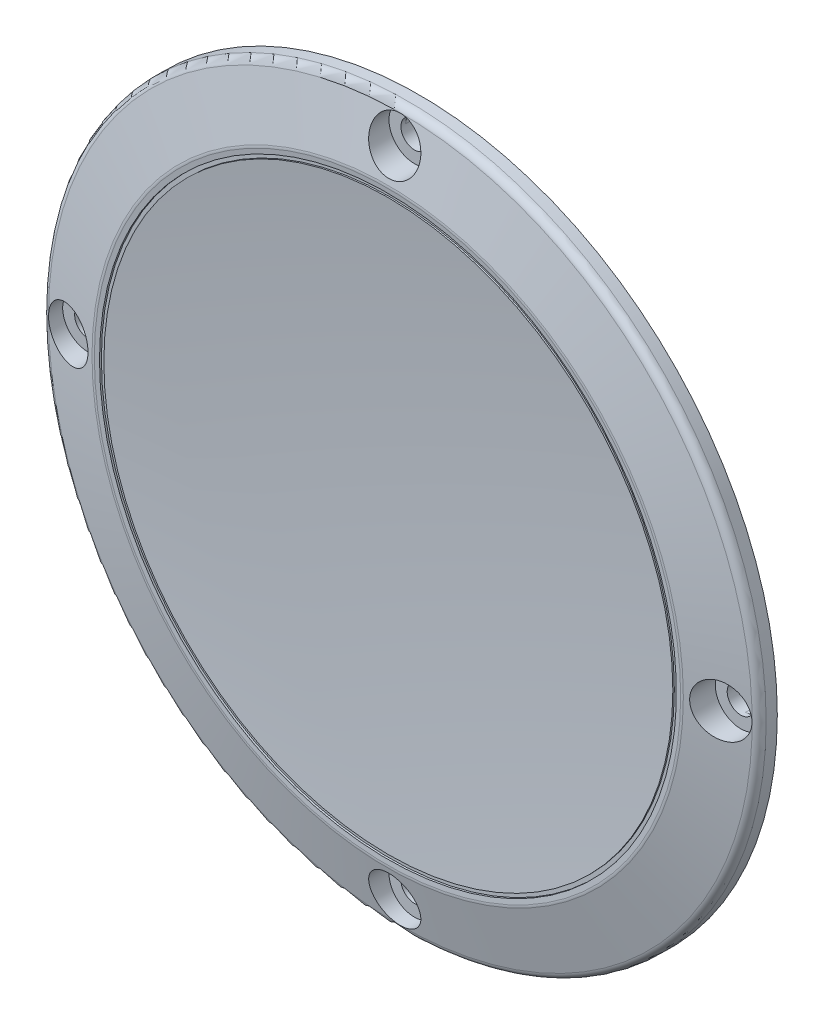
ISO-10303-21;
HEADER;
FILE_DESCRIPTION(('STEP AP214'),'2;1');
FILE_NAME('part.step','',(''),(''),'','','');
FILE_SCHEMA(('AUTOMOTIVE_DESIGN { 1 0 10303 214 1 1 1 1 }'));
ENDSEC;
DATA;
#1=APPLICATION_CONTEXT('core data for automotive mechanical design processes');
#2=APPLICATION_PROTOCOL_DEFINITION('international standard','automotive_design',2000,#1);
#3=PRODUCT_CONTEXT('',#1,'mechanical');
#4=PRODUCT('Part','Part','',(#3));
#5=PRODUCT_RELATED_PRODUCT_CATEGORY('part','',(#4));
#6=PRODUCT_DEFINITION_FORMATION('','',#4);
#7=PRODUCT_DEFINITION_CONTEXT('part definition',#1,'design');
#8=PRODUCT_DEFINITION('design','',#6,#7);
#9=PRODUCT_DEFINITION_SHAPE('','',#8);
#10=(LENGTH_UNIT() NAMED_UNIT(*) SI_UNIT(.MILLI.,.METRE.));
#11=(NAMED_UNIT(*) PLANE_ANGLE_UNIT() SI_UNIT($,.RADIAN.));
#12=(NAMED_UNIT(*) SI_UNIT($,.STERADIAN.) SOLID_ANGLE_UNIT());
#13=UNCERTAINTY_MEASURE_WITH_UNIT(LENGTH_MEASURE(1.E-05),#10,'distance_accuracy_value','');
#14=(GEOMETRIC_REPRESENTATION_CONTEXT(3) GLOBAL_UNCERTAINTY_ASSIGNED_CONTEXT((#13)) GLOBAL_UNIT_ASSIGNED_CONTEXT((#10,
#11,#12)) REPRESENTATION_CONTEXT('',''));
#15=CARTESIAN_POINT('',(0.,0.,0.));
#16=DIRECTION('',(0.,0.,1.));
#17=DIRECTION('',(1.,0.,0.));
#18=AXIS2_PLACEMENT_3D('',#15,#16,#17);
#19=CARTESIAN_POINT('',(0.,0.,25.));
#20=DIRECTION('',(0.,0.,-1.));
#21=DIRECTION('',(-1.,0.,0.));
#22=AXIS2_PLACEMENT_3D('',#19,#20,#21);
#23=CONICAL_SURFACE('',#22,36.9999999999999,1.34948188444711);
#24=CARTESIAN_POINT('',(-43.2004339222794,-2.32337912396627,23.5908551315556));
#25=CARTESIAN_POINT('',(-43.3289821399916,-2.20162359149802,23.563444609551));
#26=CARTESIAN_POINT('',(-43.4477334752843,-2.06886255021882,23.5382390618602));
#27=CARTESIAN_POINT('',(-43.6619777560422,-1.78481766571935,23.4929057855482));
#28=CARTESIAN_POINT('',(-43.7574485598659,-1.63351639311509,23.4727828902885));
#29=CARTESIAN_POINT('',(-43.9220891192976,-1.31654322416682,23.4381578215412));
#30=CARTESIAN_POINT('',(-43.9912506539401,-1.15086685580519,23.4236574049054));
#31=CARTESIAN_POINT('',(-44.1009771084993,-0.80993932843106,23.4006819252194));
#32=CARTESIAN_POINT('',(-44.1415488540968,-0.63469046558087,23.3922054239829));
#33=CARTESIAN_POINT('',(-44.1924907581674,-0.281795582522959,23.3815659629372));
#34=CARTESIAN_POINT('',(-44.2032131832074,-0.104202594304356,23.3793293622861));
#35=CARTESIAN_POINT('',(-44.1951195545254,0.250278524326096,23.3810186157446));
#36=CARTESIAN_POINT('',(-44.1763040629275,0.42716666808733,23.3849443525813));
#37=CARTESIAN_POINT('',(-44.1099490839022,0.774092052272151,23.3988099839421));
#38=CARTESIAN_POINT('',(-44.0625860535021,0.944164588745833,23.4087129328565));
#39=CARTESIAN_POINT('',(-43.9407798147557,1.27385214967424,23.4342417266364));
#40=CARTESIAN_POINT('',(-43.8663362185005,1.43346702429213,23.4498676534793));
#41=CARTESIAN_POINT('',(-43.6920652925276,1.73894122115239,23.4865652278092));
#42=CARTESIAN_POINT('',(-43.5920683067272,1.88469930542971,23.5076732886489));
#43=CARTESIAN_POINT('',(-43.3699657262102,2.15735688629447,23.5547442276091));
#44=CARTESIAN_POINT('',(-43.2478584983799,2.28425498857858,23.5807074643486));
#45=CARTESIAN_POINT('',(-42.982816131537,2.5179737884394,23.6373272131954));
#46=CARTESIAN_POINT('',(-42.8395580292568,2.62441036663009,23.6680569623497));
#47=CARTESIAN_POINT('',(-42.5379787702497,2.81178730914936,23.7330963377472));
#48=CARTESIAN_POINT('',(-42.3796559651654,2.89272487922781,23.7674063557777));
#49=CARTESIAN_POINT('',(-42.0487991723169,3.02864490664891,23.8395279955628));
#50=CARTESIAN_POINT('',(-41.8760317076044,3.08302744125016,23.8773993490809));
#51=CARTESIAN_POINT('',(-41.5242095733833,3.16191646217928,23.955013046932));
#52=CARTESIAN_POINT('',(-41.3451542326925,3.18641974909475,23.9947555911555));
#53=CARTESIAN_POINT('',(-40.9824164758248,3.20519254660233,24.075799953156));
#54=CARTESIAN_POINT('',(-40.7987087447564,3.19891062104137,24.117116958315));
#55=CARTESIAN_POINT('',(-40.4349957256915,3.15504807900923,24.1994727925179));
#56=CARTESIAN_POINT('',(-40.2549906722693,3.11746548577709,24.2405116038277));
#57=CARTESIAN_POINT('',(-39.9026338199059,3.01161713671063,24.3213769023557));
#58=CARTESIAN_POINT('',(-39.7303376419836,2.9431587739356,24.3611940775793));
#59=CARTESIAN_POINT('',(-39.3996441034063,2.77724289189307,24.4380979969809));
#60=CARTESIAN_POINT('',(-39.2412463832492,2.67978612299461,24.4751848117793));
#61=CARTESIAN_POINT('',(-38.9446253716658,2.45951627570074,24.5450307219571));
#62=CARTESIAN_POINT('',(-38.806217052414,2.33696509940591,24.5778292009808));
#63=CARTESIAN_POINT('',(-38.5520491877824,2.06920190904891,24.6383500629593));
#64=CARTESIAN_POINT('',(-38.4362867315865,1.92399281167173,24.6660730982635));
#65=CARTESIAN_POINT('',(-38.2336584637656,1.61868059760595,24.71478331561));
#66=CARTESIAN_POINT('',(-38.1461730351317,1.45901183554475,24.7359145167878));
#67=CARTESIAN_POINT('',(-37.9993429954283,1.1265282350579,24.7714705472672));
#68=CARTESIAN_POINT('',(-37.9399936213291,0.953715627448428,24.7858965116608));
#69=CARTESIAN_POINT('',(-37.8526627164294,0.604779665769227,24.8071509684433));
#70=CARTESIAN_POINT('',(-37.8238920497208,0.42886521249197,24.8141705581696));
#71=CARTESIAN_POINT('',(-37.7959391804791,0.0745694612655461,24.8209903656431));
#72=CARTESIAN_POINT('',(-37.7967537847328,-0.103811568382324,24.8207913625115));
#73=CARTESIAN_POINT('',(-37.8277001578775,-0.455133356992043,24.8132417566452));
#74=CARTESIAN_POINT('',(-37.8573903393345,-0.628115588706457,24.8059988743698));
#75=CARTESIAN_POINT('',(-37.9444555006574,-0.966527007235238,24.7848122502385));
#76=CARTESIAN_POINT('',(-38.0018304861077,-1.13195619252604,24.7708685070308));
#77=CARTESIAN_POINT('',(-38.1427484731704,-1.4514611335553,24.7367434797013));
#78=CARTESIAN_POINT('',(-38.2264088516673,-1.60548205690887,24.7165342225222));
#79=CARTESIAN_POINT('',(-38.4172288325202,-1.89728581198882,24.6706472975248));
#80=CARTESIAN_POINT('',(-38.5243906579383,-2.03506710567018,24.6449691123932));
#81=CARTESIAN_POINT('',(-38.7615604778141,-2.29364594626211,24.5884379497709));
#82=CARTESIAN_POINT('',(-38.8920036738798,-2.41402272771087,24.5574870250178));
#83=CARTESIAN_POINT('',(-39.1703495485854,-2.63126595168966,24.4918372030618));
#84=CARTESIAN_POINT('',(-39.3182546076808,-2.72812918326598,24.4571377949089));
#85=CARTESIAN_POINT('',(-39.6315768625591,-2.89828118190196,24.3840981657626));
#86=CARTESIAN_POINT('',(-39.7973554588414,-2.97087364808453,24.3456856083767));
#87=CARTESIAN_POINT('',(-40.1383968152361,-3.08708651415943,24.2671947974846));
#88=CARTESIAN_POINT('',(-40.3136603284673,-3.13070460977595,24.2271164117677));
#89=CARTESIAN_POINT('',(-40.6723684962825,-3.18846262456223,24.1456407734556));
#90=CARTESIAN_POINT('',(-40.8559059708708,-3.20201270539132,24.1042330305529));
#91=CARTESIAN_POINT('',(-41.2227854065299,-3.19750350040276,24.0220137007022));
#92=CARTESIAN_POINT('',(-41.4061272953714,-3.17943503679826,23.9812022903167));
#93=CARTESIAN_POINT('',(-41.7682797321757,-3.11188987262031,23.9010963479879));
#94=CARTESIAN_POINT('',(-41.9470625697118,-3.06225428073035,23.861810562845));
#95=CARTESIAN_POINT('',(-42.2937471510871,-2.93264120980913,23.7860731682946));
#96=CARTESIAN_POINT('',(-42.4616618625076,-2.85270070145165,23.7496181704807));
#97=CARTESIAN_POINT('',(-42.7256373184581,-2.69755031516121,23.6926023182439));
#98=CARTESIAN_POINT('',(-42.8263079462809,-2.63044312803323,23.6709378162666));
#99=CARTESIAN_POINT('',(-43.0196636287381,-2.48507274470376,23.6294554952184));
#100=CARTESIAN_POINT('',(-43.1123487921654,-2.40680970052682,23.6096376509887));
#101=CARTESIAN_POINT('',(-43.2004339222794,-2.32337912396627,23.5908551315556));
#102=B_SPLINE_CURVE_WITH_KNOTS('',3,(#24,#25,#26,#27,#28,#29,#30,#31,#32,#33,#34,#35,#36,#37,
#38,#39,#40,#41,#42,#43,#44,#45,#46,#47,#48,#49,#50,#51,#52,#53,#54,#55,#56,#57,#58,#59,#60,#61,
#62,#63,#64,#65,#66,#67,#68,#69,#70,#71,#72,#73,#74,#75,#76,#77,#78,#79,#80,#81,#82,#83,#84,#85,
#86,#87,#88,#89,#90,#91,#92,#93,#94,#95,#96,#97,#98,#99,#100,#101),.UNSPECIFIED.,.T.,.F.,(4,2,2,
2,2,2,2,2,2,2,2,2,2,2,2,2,2,2,2,2,2,2,2,2,2,2,2,2,2,2,2,2,2,2,2,2,2,2,4),(0.,0.53706100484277,
1.07463082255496,1.61236847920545,2.14997770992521,2.68121489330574,3.21244196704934,
3.74041863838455,4.26840287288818,4.79998799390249,5.33161239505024,5.87240783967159,
6.41326252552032,6.9658277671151,7.51845217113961,8.08101118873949,8.64360573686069,
9.20975943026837,9.77589847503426,10.3364053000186,10.8968400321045,11.443997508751,
11.9910623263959,12.5236383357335,13.0561568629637,13.5806577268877,14.1051586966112,
14.6320359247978,15.1589630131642,15.6970329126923,16.2351762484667,16.787647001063,
17.3401616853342,17.9034225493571,18.4668469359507,19.0331299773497,19.5987243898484,
19.9667398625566,20.3347503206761),.UNSPECIFIED.);
#103=CARTESIAN_POINT('',(-43.2004339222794,-2.32337912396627,23.5908551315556));
#104=VERTEX_POINT('',#103);
#105=EDGE_CURVE('E956',#104,#104,#102,.T.);
#106=ORIENTED_EDGE('',*,*,#105,.T.);
#107=EDGE_LOOP('',(#106));
#108=FACE_BOUND('',#107,.T.);
#109=CARTESIAN_POINT('',(-2.32337912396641,-43.2004339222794,23.5908551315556));
#110=CARTESIAN_POINT('',(-2.44899882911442,-43.0677825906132,23.6191406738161));
#111=CARTESIAN_POINT('',(-2.56308341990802,-42.9245028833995,23.6498161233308));
#112=CARTESIAN_POINT('',(-2.76500761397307,-42.6211206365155,23.7151212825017));
#113=CARTESIAN_POINT('',(-2.85280816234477,-42.4609935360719,23.7497567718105));
#114=CARTESIAN_POINT('',(-2.99972284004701,-42.1289641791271,23.8220036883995));
#115=CARTESIAN_POINT('',(-3.05887504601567,-41.9570779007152,23.8596110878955));
#116=CARTESIAN_POINT('',(-3.14724332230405,-41.6062821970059,23.9368508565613));
#117=CARTESIAN_POINT('',(-3.17646720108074,-41.4273746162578,23.9764826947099));
#118=CARTESIAN_POINT('',(-3.20457437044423,-41.0648801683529,24.0573134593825));
#119=CARTESIAN_POINT('',(-3.2030254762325,-40.8812628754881,24.0985265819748));
#120=CARTESIAN_POINT('',(-3.16861832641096,-40.5169437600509,24.1808525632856));
#121=CARTESIAN_POINT('',(-3.13575640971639,-40.3362422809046,24.2219654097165));
#122=CARTESIAN_POINT('',(-3.03919680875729,-39.9815108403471,24.3032105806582));
#123=CARTESIAN_POINT('',(-2.97527134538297,-39.8075405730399,24.3433333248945));
#124=CARTESIAN_POINT('',(-2.81810575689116,-39.4727569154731,24.421036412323));
#125=CARTESIAN_POINT('',(-2.72486622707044,-39.3119432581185,24.4586168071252));
#126=CARTESIAN_POINT('',(-2.51241909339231,-39.0096270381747,24.5296749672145));
#127=CARTESIAN_POINT('',(-2.39344442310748,-38.8679686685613,24.5631855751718));
#128=CARTESIAN_POINT('',(-2.13222629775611,-38.6067352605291,24.6252901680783));
#129=CARTESIAN_POINT('',(-1.98998573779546,-38.4871574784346,24.6538847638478));
#130=CARTESIAN_POINT('',(-1.68971946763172,-38.2764518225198,24.7044708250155));
#131=CARTESIAN_POINT('',(-1.53213079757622,-38.184734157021,24.7265987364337));
#132=CARTESIAN_POINT('',(-1.20302095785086,-38.0291665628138,24.7642343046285));
#133=CARTESIAN_POINT('',(-1.03150214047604,-37.9653119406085,24.7797430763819));
#134=CARTESIAN_POINT('',(-0.684349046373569,-37.8689862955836,24.8031727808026));
#135=CARTESIAN_POINT('',(-0.508948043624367,-37.835720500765,24.8112858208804));
#136=CARTESIAN_POINT('',(-0.15488095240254,-37.7987998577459,24.820291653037));
#137=CARTESIAN_POINT('',(0.0237847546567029,-37.7951415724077,24.8211852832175));
#138=CARTESIAN_POINT('',(0.376211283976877,-37.8173697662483,24.8157616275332));
#139=CARTESIAN_POINT('',(0.550004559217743,-37.8427747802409,24.8095618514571));
#140=CARTESIAN_POINT('',(0.890749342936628,-37.9215032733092,24.7903936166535));
#141=CARTESIAN_POINT('',(1.05770089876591,-37.9748265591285,24.7774252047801));
#142=CARTESIAN_POINT('',(1.38065435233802,-38.1078747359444,24.745177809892));
#143=CARTESIAN_POINT('',(1.53662167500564,-38.1876788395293,24.7258798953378));
#144=CARTESIAN_POINT('',(1.83292472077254,-38.3711671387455,24.6817038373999));
#145=CARTESIAN_POINT('',(1.97325907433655,-38.474853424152,24.6568252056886));
#146=CARTESIAN_POINT('',(2.23740413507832,-38.7053615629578,24.6018023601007));
#147=CARTESIAN_POINT('',(2.36082333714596,-38.8326088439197,24.5715618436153));
#148=CARTESIAN_POINT('',(2.58464511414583,-39.1050837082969,24.5071891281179));
#149=CARTESIAN_POINT('',(2.68504461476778,-39.2503136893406,24.4730564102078));
#150=CARTESIAN_POINT('',(2.86277708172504,-39.5588093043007,24.4010091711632));
#151=CARTESIAN_POINT('',(2.9394238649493,-39.7224524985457,24.3630180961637));
#152=CARTESIAN_POINT('',(3.06407748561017,-40.059897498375,24.285202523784));
#153=CARTESIAN_POINT('',(3.11208087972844,-40.2337005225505,24.2453778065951));
#154=CARTESIAN_POINT('',(3.17895814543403,-40.5903567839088,24.1642045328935));
#155=CARTESIAN_POINT('',(3.19721644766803,-40.7733224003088,24.1228414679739));
#156=CARTESIAN_POINT('',(3.20219369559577,-41.1397879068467,24.0405499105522));
#157=CARTESIAN_POINT('',(3.18891086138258,-41.3232878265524,23.9996214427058));
#158=CARTESIAN_POINT('',(3.13089166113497,-41.6867107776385,23.919078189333));
#159=CARTESIAN_POINT('',(3.08597190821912,-41.8666066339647,23.8794724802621));
#160=CARTESIAN_POINT('',(2.96554353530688,-42.2164586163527,23.8029038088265));
#161=CARTESIAN_POINT('',(2.89003595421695,-42.3864150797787,23.7659407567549));
#162=CARTESIAN_POINT('',(2.71123869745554,-42.7096672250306,23.6960076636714));
#163=CARTESIAN_POINT('',(2.60823089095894,-42.863110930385,23.6630017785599));
#164=CARTESIAN_POINT('',(2.37682253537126,-43.1505211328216,23.6014551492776));
#165=CARTESIAN_POINT('',(2.24842460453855,-43.2844896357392,23.5729139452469));
#166=CARTESIAN_POINT('',(1.97262109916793,-43.5262054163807,23.5216035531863));
#167=CARTESIAN_POINT('',(1.82564976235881,-43.6344258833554,23.4987298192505));
#168=CARTESIAN_POINT('',(1.5148899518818,-43.8245845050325,23.4586438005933));
#169=CARTESIAN_POINT('',(1.35110358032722,-43.9065259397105,23.4414308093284));
#170=CARTESIAN_POINT('',(1.01514662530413,-44.0399751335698,23.4134454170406));
#171=CARTESIAN_POINT('',(0.843230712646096,-44.0920970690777,23.4025429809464));
#172=CARTESIAN_POINT('',(0.492846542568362,-44.1668882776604,23.3869100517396));
#173=CARTESIAN_POINT('',(0.314379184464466,-44.1895615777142,23.3821787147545));
#174=CARTESIAN_POINT('',(-0.0412894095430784,-44.2046098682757,23.3790378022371));
#175=CARTESIAN_POINT('',(-0.218471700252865,-44.1974177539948,23.3805379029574));
#176=CARTESIAN_POINT('',(-0.569114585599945,-44.1539370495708,23.3896174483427));
#177=CARTESIAN_POINT('',(-0.742574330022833,-44.1176418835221,23.3971982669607));
#178=CARTESIAN_POINT('',(-1.08050662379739,-44.0172074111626,23.4182186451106));
#179=CARTESIAN_POINT('',(-1.24499409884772,-43.9531160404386,23.431648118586));
#180=CARTESIAN_POINT('',(-1.56064509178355,-43.799134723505,23.464006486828));
#181=CARTESIAN_POINT('',(-1.71182435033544,-43.709275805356,23.4829287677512));
#182=CARTESIAN_POINT('',(-1.93906675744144,-43.5477170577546,23.5170748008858));
#183=CARTESIAN_POINT('',(-2.02074274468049,-43.4834157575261,23.5306897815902));
#184=CARTESIAN_POINT('',(-2.17730681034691,-43.3473585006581,23.5595657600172));
#185=CARTESIAN_POINT('',(-2.25219497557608,-43.2756026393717,23.5748267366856));
#186=CARTESIAN_POINT('',(-2.32337912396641,-43.2004339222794,23.5908551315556));
#187=B_SPLINE_CURVE_WITH_KNOTS('',3,(#109,#110,#111,#112,#113,#114,#115,#116,#117,#118,#119,
#120,#121,#122,#123,#124,#125,#126,#127,#128,#129,#130,#131,#132,#133,#134,#135,#136,#137,#138,
#139,#140,#141,#142,#143,#144,#145,#146,#147,#148,#149,#150,#151,#152,#153,#154,#155,#156,#157,
#158,#159,#160,#161,#162,#163,#164,#165,#166,#167,#168,#169,#170,#171,#172,#173,#174,#175,#176,
#177,#178,#179,#180,#181,#182,#183,#184,#185,#186),.UNSPECIFIED.,.T.,.F.,(4,2,2,2,2,2,2,2,2,2,2,
2,2,2,2,2,2,2,2,2,2,2,2,2,2,2,2,2,2,2,2,2,2,2,2,2,2,2,4),(0.,0.554216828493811,1.10925311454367,
1.66354966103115,2.21770155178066,2.77964160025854,3.34164735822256,3.90783777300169,
4.47401669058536,5.03527079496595,5.59645511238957,6.14476395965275,6.69298040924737,
7.22651339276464,7.75998443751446,8.28474435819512,8.80950064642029,9.33584101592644,
9.86222745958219,10.3992579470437,10.9363601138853,11.487778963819,12.0392640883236,
12.6020234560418,13.1648145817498,13.7308951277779,14.296956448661,14.8574248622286,
15.4178355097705,15.9669747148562,16.5160453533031,17.0533572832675,17.5905957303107,
18.1200743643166,18.6496726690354,19.1783612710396,19.7064159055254,20.0204745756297,
20.3345292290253),.UNSPECIFIED.);
#188=CARTESIAN_POINT('',(-2.32337912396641,-43.2004339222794,23.5908551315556));
#189=VERTEX_POINT('',#188);
#190=EDGE_CURVE('E766',#189,#189,#187,.T.);
#191=ORIENTED_EDGE('',*,*,#190,.T.);
#192=EDGE_LOOP('',(#191));
#193=FACE_BOUND('',#192,.T.);
#194=CARTESIAN_POINT('',(0.,0.,24.964763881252));
#195=DIRECTION('',(0.,0.,-1.));
#196=DIRECTION('',(-1.,0.,0.));
#197=AXIS2_PLACEMENT_3D('',#194,#195,#196);
#198=CIRCLE('',#197,37.1566049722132);
#199=CARTESIAN_POINT('',(-37.1566049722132,0.,24.964763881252));
#200=VERTEX_POINT('',#199);
#201=EDGE_CURVE('E439',#200,#200,#198,.T.);
#202=ORIENTED_EDGE('',*,*,#201,.T.);
#203=EDGE_LOOP('',(#202));
#204=FACE_BOUND('',#203,.T.);
#205=CARTESIAN_POINT('',(0.,0.,23.3756097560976));
#206=DIRECTION('',(0.,0.,-1.));
#207=DIRECTION('',(-1.,0.,0.));
#208=AXIS2_PLACEMENT_3D('',#205,#206,#207);
#209=CIRCLE('',#208,44.219512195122);
#210=CARTESIAN_POINT('',(-44.219512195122,0.,23.3756097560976));
#211=VERTEX_POINT('',#210);
#212=EDGE_CURVE('E434',#211,#211,#209,.F.);
#213=ORIENTED_EDGE('',*,*,#212,.T.);
#214=EDGE_LOOP('',(#213));
#215=FACE_BOUND('',#214,.T.);
#216=CARTESIAN_POINT('',(38.7868998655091,-2.31131853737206,24.5824655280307));
#217=CARTESIAN_POINT('',(38.6592967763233,-2.18912894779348,24.6127605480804));
#218=CARTESIAN_POINT('',(38.5414863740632,-2.05601605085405,24.6408898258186));
#219=CARTESIAN_POINT('',(38.3290660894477,-1.77135485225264,24.6918106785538));
#220=CARTESIAN_POINT('',(38.2344770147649,-1.61979019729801,24.7145974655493));
#221=CARTESIAN_POINT('',(38.0715279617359,-1.30226741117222,24.7539676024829));
#222=CARTESIAN_POINT('',(38.0031841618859,-1.13630047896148,24.7705471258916));
#223=CARTESIAN_POINT('',(37.895110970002,-0.794812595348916,24.7968097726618));
#224=CARTESIAN_POINT('',(37.8553740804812,-0.619294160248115,24.8064947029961));
#225=CARTESIAN_POINT('',(37.8062664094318,-0.266825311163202,24.8184687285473));
#226=CARTESIAN_POINT('',(37.7963969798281,-0.0899484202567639,24.8208792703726));
#227=CARTESIAN_POINT('',(37.8059420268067,0.262962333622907,24.8185499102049));
#228=CARTESIAN_POINT('',(37.8253553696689,0.438996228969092,24.8138102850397));
#229=CARTESIAN_POINT('',(37.8924981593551,0.783557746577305,24.7974521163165));
#230=CARTESIAN_POINT('',(37.9399673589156,0.952139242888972,24.785896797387));
#231=CARTESIAN_POINT('',(38.0614701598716,1.27883546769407,24.7564138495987));
#232=CARTESIAN_POINT('',(38.135504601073,1.43694986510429,24.738486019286));
#233=CARTESIAN_POINT('',(38.3087556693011,1.74011788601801,24.6967072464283));
#234=CARTESIAN_POINT('',(38.4082321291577,1.88501445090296,24.6727952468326));
#235=CARTESIAN_POINT('',(38.6289633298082,2.15609567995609,24.620004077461));
#236=CARTESIAN_POINT('',(38.7502204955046,2.28227825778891,24.5911243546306));
#237=CARTESIAN_POINT('',(39.0142215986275,2.51564493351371,24.5286052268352));
#238=CARTESIAN_POINT('',(39.1574161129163,2.62229277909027,24.4948672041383));
#239=CARTESIAN_POINT('',(39.458943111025,2.81010771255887,24.4242720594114));
#240=CARTESIAN_POINT('',(39.617277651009,2.8912713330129,24.3874145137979));
#241=CARTESIAN_POINT('',(39.9489677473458,3.02792276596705,24.3107094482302));
#242=CARTESIAN_POINT('',(40.1226040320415,3.08270027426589,24.2708095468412));
#243=CARTESIAN_POINT('',(40.4764329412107,3.16208175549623,24.1900562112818));
#244=CARTESIAN_POINT('',(40.6566262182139,3.18668271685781,24.1492026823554));
#245=CARTESIAN_POINT('',(41.0214065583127,3.20521407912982,24.0670519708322));
#246=CARTESIAN_POINT('',(41.2060186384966,3.19866872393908,24.0257575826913));
#247=CARTESIAN_POINT('',(41.5716707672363,3.15390549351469,23.9444976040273));
#248=CARTESIAN_POINT('',(41.7527107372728,3.11568692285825,23.9045320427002));
#249=CARTESIAN_POINT('',(42.1058808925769,3.00849768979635,23.8270362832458));
#250=CARTESIAN_POINT('',(42.278016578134,2.93954627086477,23.7895045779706));
#251=CARTESIAN_POINT('',(42.608372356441,2.77261259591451,23.7178638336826));
#252=CARTESIAN_POINT('',(42.7665933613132,2.67463224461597,23.6837545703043));
#253=CARTESIAN_POINT('',(43.0620207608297,2.45388815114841,23.620362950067));
#254=CARTESIAN_POINT('',(43.1995041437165,2.33151373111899,23.5910164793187));
#255=CARTESIAN_POINT('',(43.4519135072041,2.06442915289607,23.5373418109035));
#256=CARTESIAN_POINT('',(43.5668422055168,1.91972168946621,23.5130130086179));
#257=CARTESIAN_POINT('',(43.7681874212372,1.61545507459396,23.4705133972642));
#258=CARTESIAN_POINT('',(43.8551697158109,1.45628740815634,23.452220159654));
#259=CARTESIAN_POINT('',(44.0011592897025,1.12507087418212,23.4215751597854));
#260=CARTESIAN_POINT('',(44.0601699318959,0.9530235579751,23.4092226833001));
#261=CARTESIAN_POINT('',(44.147404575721,0.604548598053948,23.3909791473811));
#262=CARTESIAN_POINT('',(44.1762066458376,0.428271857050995,23.3849667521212));
#263=CARTESIAN_POINT('',(44.2041099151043,0.0732862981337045,23.3791418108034));
#264=CARTESIAN_POINT('',(44.203213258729,-0.105422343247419,23.3793288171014));
#265=CARTESIAN_POINT('',(44.1719098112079,-0.458323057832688,23.3858639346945));
#266=CARTESIAN_POINT('',(44.1417958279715,-0.632542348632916,23.3921509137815));
#267=CARTESIAN_POINT('',(44.0534495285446,-0.973363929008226,23.4106295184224));
#268=CARTESIAN_POINT('',(43.9952173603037,-1.13996625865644,23.422821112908));
#269=CARTESIAN_POINT('',(43.8522445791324,-1.46141590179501,23.4528355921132));
#270=CARTESIAN_POINT('',(43.7674260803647,-1.61622699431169,23.4706750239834));
#271=CARTESIAN_POINT('',(43.573934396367,-1.90937483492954,23.5115150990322));
#272=CARTESIAN_POINT('',(43.4652597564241,-2.04771057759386,23.534516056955));
#273=CARTESIAN_POINT('',(43.2255313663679,-2.30619400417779,23.5854713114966));
#274=CARTESIAN_POINT('',(43.0941744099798,-2.42604707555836,23.6134929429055));
#275=CARTESIAN_POINT('',(42.8140579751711,-2.6420610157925,23.6735475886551));
#276=CARTESIAN_POINT('',(42.6652966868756,-2.73821941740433,23.7055810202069));
#277=CARTESIAN_POINT('',(42.351267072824,-2.90627850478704,23.7735785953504));
#278=CARTESIAN_POINT('',(42.1857164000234,-2.9776237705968,23.8096114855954));
#279=CARTESIAN_POINT('',(41.8455094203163,-3.09148832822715,23.8841137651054));
#280=CARTESIAN_POINT('',(41.6708524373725,-3.13400547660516,23.9225833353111));
#281=CARTESIAN_POINT('',(41.3136856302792,-3.18981436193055,24.0017597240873));
#282=CARTESIAN_POINT('',(41.1310887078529,-3.20250792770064,24.0424958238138));
#283=CARTESIAN_POINT('',(40.7664345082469,-3.19667159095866,24.1243960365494));
#284=CARTESIAN_POINT('',(40.584377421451,-3.17813174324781,24.1655602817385));
#285=CARTESIAN_POINT('',(40.2239335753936,-3.10994281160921,24.2476060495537));
#286=CARTESIAN_POINT('',(40.0456095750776,-3.05995234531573,24.2884794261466));
#287=CARTESIAN_POINT('',(39.699990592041,-2.92984577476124,24.3682177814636));
#288=CARTESIAN_POINT('',(39.5326831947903,-2.84976428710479,24.4070850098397));
#289=CARTESIAN_POINT('',(39.2677625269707,-2.69340355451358,24.4690027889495));
#290=CARTESIAN_POINT('',(39.1656684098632,-2.62494371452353,24.4929682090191));
#291=CARTESIAN_POINT('',(38.969759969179,-2.4765351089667,24.5391291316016));
#292=CARTESIAN_POINT('',(38.8759455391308,-2.3965864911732,24.5613246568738));
#293=CARTESIAN_POINT('',(38.7868998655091,-2.31131853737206,24.5824655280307));
#294=B_SPLINE_CURVE_WITH_KNOTS('',3,(#216,#217,#218,#219,#220,#221,#222,#223,#224,#225,#226,
#227,#228,#229,#230,#231,#232,#233,#234,#235,#236,#237,#238,#239,#240,#241,#242,#243,#244,#245,
#246,#247,#248,#249,#250,#251,#252,#253,#254,#255,#256,#257,#258,#259,#260,#261,#262,#263,#264,
#265,#266,#267,#268,#269,#270,#271,#272,#273,#274,#275,#276,#277,#278,#279,#280,#281,#282,#283,
#284,#285,#286,#287,#288,#289,#290,#291,#292,#293),.UNSPECIFIED.,.T.,.F.,(4,2,2,2,2,2,2,2,2,2,2,
2,2,2,2,2,2,2,2,2,2,2,2,2,2,2,2,2,2,2,2,2,2,2,2,2,2,2,4),(0.,0.537310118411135,1.07509995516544,
1.61322077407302,2.15120050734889,2.6801475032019,3.20907402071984,3.73316953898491,
4.25728162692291,4.78697639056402,5.31673016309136,5.85935863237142,6.40206090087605,
6.95865292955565,7.51530050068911,8.08047784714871,8.64566760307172,9.21050395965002,
9.77530326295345,10.3317217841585,10.8880732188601,11.4323238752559,11.9765090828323,
12.51007947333,13.0436113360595,13.5718509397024,14.1000877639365,14.629886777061,
15.1597181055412,15.6972749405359,16.2348877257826,16.7838587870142,17.3328706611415,
17.8928034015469,18.4529144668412,19.0192127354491,19.5848615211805,19.9598191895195,
20.3347720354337),.UNSPECIFIED.);
#295=CARTESIAN_POINT('',(38.7868998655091,-2.31131853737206,24.5824655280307));
#296=VERTEX_POINT('',#295);
#297=EDGE_CURVE('E775',#296,#296,#294,.T.);
#298=ORIENTED_EDGE('',*,*,#297,.T.);
#299=EDGE_LOOP('',(#298));
#300=FACE_BOUND('',#299,.T.);
#301=CARTESIAN_POINT('',(-2.31131853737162,38.7868998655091,24.5824655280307));
#302=CARTESIAN_POINT('',(-2.43814417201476,38.9193661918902,24.5510157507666));
#303=CARTESIAN_POINT('',(-2.55338270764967,39.0625817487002,24.5171858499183));
#304=CARTESIAN_POINT('',(-2.75752171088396,39.3661027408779,24.4459474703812));
#305=CARTESIAN_POINT('',(-2.84638161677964,39.5264339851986,24.4085335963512));
#306=CARTESIAN_POINT('',(-2.995284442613,39.8591946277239,24.3314055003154));
#307=CARTESIAN_POINT('',(-3.05536471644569,40.0316080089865,24.291694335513));
#308=CARTESIAN_POINT('',(-3.1453683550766,40.3838070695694,24.2111272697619));
#309=CARTESIAN_POINT('',(-3.17530031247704,40.5635906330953,24.1702716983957));
#310=CARTESIAN_POINT('',(-3.20446623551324,40.9278980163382,24.0880403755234));
#311=CARTESIAN_POINT('',(-3.20331236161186,41.1124529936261,24.0466644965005));
#312=CARTESIAN_POINT('',(-3.16930928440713,41.4788957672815,23.9650476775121));
#313=CARTESIAN_POINT('',(-3.13645741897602,41.6607833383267,23.9248068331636));
#314=CARTESIAN_POINT('',(-3.03976621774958,42.0167927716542,23.8465233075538));
#315=CARTESIAN_POINT('',(-2.97590331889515,42.1909086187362,23.8084823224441));
#316=CARTESIAN_POINT('',(-2.81875453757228,42.5260640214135,23.7356608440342));
#317=CARTESIAN_POINT('',(-2.72547048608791,42.6871043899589,23.7008801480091));
#318=CARTESIAN_POINT('',(-2.51341081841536,42.9890524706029,23.6359794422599));
#319=CARTESIAN_POINT('',(-2.39500632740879,43.1302082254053,23.6058015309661));
#320=CARTESIAN_POINT('',(-2.13516159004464,43.3905858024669,23.5503534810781));
#321=CARTESIAN_POINT('',(-1.99372411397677,43.5098102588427,23.5250827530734));
#322=CARTESIAN_POINT('',(-1.69508770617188,43.7201689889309,23.4806304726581));
#323=CARTESIAN_POINT('',(-1.53829345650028,43.811852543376,23.4613295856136));
#324=CARTESIAN_POINT('',(-1.2109576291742,43.9675607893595,23.4286178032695));
#325=CARTESIAN_POINT('',(-1.04041771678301,44.0315888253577,23.4152061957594));
#326=CARTESIAN_POINT('',(-0.69411451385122,44.1288828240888,23.3948488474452));
#327=CARTESIAN_POINT('',(-0.518524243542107,44.1627392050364,23.3877789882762));
#328=CARTESIAN_POINT('',(-0.164024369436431,44.2007604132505,23.3798404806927));
#329=CARTESIAN_POINT('',(0.0148849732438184,44.2049275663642,23.3789713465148));
#330=CARTESIAN_POINT('',(0.368869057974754,44.1835571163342,23.3834321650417));
#331=CARTESIAN_POINT('',(0.543964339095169,44.1583435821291,23.3886944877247));
#332=CARTESIAN_POINT('',(0.887353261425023,44.0795510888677,23.4051674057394));
#333=CARTESIAN_POINT('',(1.05564697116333,44.0259724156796,23.416377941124));
#334=CARTESIAN_POINT('',(1.38105061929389,43.8920090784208,23.4444800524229));
#335=CARTESIAN_POINT('',(1.53813928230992,43.8115749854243,23.4613821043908));
#336=CARTESIAN_POINT('',(1.83653626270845,43.6263993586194,23.5004264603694));
#337=CARTESIAN_POINT('',(1.97784371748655,43.5216564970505,23.5225690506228));
#338=CARTESIAN_POINT('',(2.24280378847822,43.2893870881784,23.5718744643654));
#339=CARTESIAN_POINT('',(2.36618699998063,43.1615671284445,23.5991021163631));
#340=CARTESIAN_POINT('',(2.58980030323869,42.887900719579,23.6576823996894));
#341=CARTESIAN_POINT('',(2.69002809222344,42.7420524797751,23.6890354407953));
#342=CARTESIAN_POINT('',(2.86671706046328,42.4332579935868,23.7557799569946));
#343=CARTESIAN_POINT('',(2.94263978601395,42.2700189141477,23.791241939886));
#344=CARTESIAN_POINT('',(3.06600304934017,41.9336623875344,23.8647546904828));
#345=CARTESIAN_POINT('',(3.11344038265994,41.7605438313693,23.9028057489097));
#346=CARTESIAN_POINT('',(3.17942641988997,41.4055781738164,23.9813255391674));
#347=CARTESIAN_POINT('',(3.1973655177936,41.2236250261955,24.0218277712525));
#348=CARTESIAN_POINT('',(3.20209536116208,40.8594439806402,24.1034379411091));
#349=CARTESIAN_POINT('',(3.18888342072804,40.6772160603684,24.1445459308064));
#350=CARTESIAN_POINT('',(3.13134038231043,40.3154232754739,24.2267099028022));
#351=CARTESIAN_POINT('',(3.0866477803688,40.1359143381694,24.2677596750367));
#352=CARTESIAN_POINT('',(2.96688844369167,39.7869002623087,24.3480985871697));
#353=CARTESIAN_POINT('',(2.89182134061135,39.6173952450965,24.3873877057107));
#354=CARTESIAN_POINT('',(2.71353199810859,39.2939133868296,24.4628302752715));
#355=CARTESIAN_POINT('',(2.61040790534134,39.1398849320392,24.4989940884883));
#356=CARTESIAN_POINT('',(2.37857770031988,38.8513717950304,24.5671067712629));
#357=CARTESIAN_POINT('',(2.24987387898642,38.7168853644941,24.5990560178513));
#358=CARTESIAN_POINT('',(1.97309740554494,38.4741099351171,24.6569985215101));
#359=CARTESIAN_POINT('',(1.82544468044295,38.3653670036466,24.6830944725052));
#360=CARTESIAN_POINT('',(1.5130315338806,38.1743604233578,24.7290928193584));
#361=CARTESIAN_POINT('',(1.34827390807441,38.0920924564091,24.7489962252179));
#362=CARTESIAN_POINT('',(1.0111256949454,37.9586842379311,24.7813462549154));
#363=CARTESIAN_POINT('',(0.839062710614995,37.9067612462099,24.7939802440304));
#364=CARTESIAN_POINT('',(0.488326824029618,37.83240518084,24.8120903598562));
#365=CARTESIAN_POINT('',(0.309655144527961,37.8099666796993,24.8175678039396));
#366=CARTESIAN_POINT('',(-0.0451944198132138,37.7954985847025,24.8210984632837));
#367=CARTESIAN_POINT('',(-0.221345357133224,37.8028372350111,24.8193059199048));
#368=CARTESIAN_POINT('',(-0.569893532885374,37.8462619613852,24.8087157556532));
#369=CARTESIAN_POINT('',(-0.742289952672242,37.882354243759,24.7999166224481));
#370=CARTESIAN_POINT('',(-1.07791108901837,37.9819413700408,24.7757044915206));
#371=CARTESIAN_POINT('',(-1.24116071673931,38.0453572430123,24.760310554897));
#372=CARTESIAN_POINT('',(-1.55447520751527,38.1975236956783,24.7235128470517));
#373=CARTESIAN_POINT('',(-1.70455519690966,38.2862446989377,24.7021160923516));
#374=CARTESIAN_POINT('',(-1.93004507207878,38.4454907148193,24.6638904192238));
#375=CARTESIAN_POINT('',(-2.0109932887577,38.5087342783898,24.6487445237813));
#376=CARTESIAN_POINT('',(-2.16626818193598,38.6425043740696,24.6168009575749));
#377=CARTESIAN_POINT('',(-2.24059496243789,38.71303079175,24.6000033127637));
#378=CARTESIAN_POINT('',(-2.31131853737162,38.7868998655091,24.5824655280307));
#379=B_SPLINE_CURVE_WITH_KNOTS('',3,(#301,#302,#303,#304,#305,#306,#307,#308,#309,#310,#311,
#312,#313,#314,#315,#316,#317,#318,#319,#320,#321,#322,#323,#324,#325,#326,#327,#328,#329,#330,
#331,#332,#333,#334,#335,#336,#337,#338,#339,#340,#341,#342,#343,#344,#345,#346,#347,#348,#349,
#350,#351,#352,#353,#354,#355,#356,#357,#358,#359,#360,#361,#362,#363,#364,#365,#366,#367,#368,
#369,#370,#371,#372,#373,#374,#375,#376,#377,#378),.UNSPECIFIED.,.T.,.F.,(4,2,2,2,2,2,2,2,2,2,2,
2,2,2,2,2,2,2,2,2,2,2,2,2,2,2,2,2,2,2,2,2,2,2,2,2,2,2,4),(0.,0.557814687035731,1.11648271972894,
1.67442366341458,2.23220554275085,2.79694972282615,3.36174133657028,3.92696276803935,
4.49214903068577,5.04950398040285,5.60679194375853,6.15208721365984,6.69731652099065,
7.23162600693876,7.76589363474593,8.29432363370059,8.82274830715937,9.35215098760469,
9.88158259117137,10.4182922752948,10.9550553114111,11.502997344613,12.0510010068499,
12.6101934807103,13.1694341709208,13.7352037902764,14.3009802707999,14.864802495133,
15.4285742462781,15.9815076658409,16.5343508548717,17.0722203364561,17.6099907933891,
18.1364121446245,18.6629471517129,19.1879704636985,19.7123826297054,20.0234496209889,
20.3345117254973),.UNSPECIFIED.);
#380=CARTESIAN_POINT('',(-2.31131853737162,38.7868998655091,24.5824655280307));
#381=VERTEX_POINT('',#380);
#382=EDGE_CURVE('E706',#381,#381,#379,.T.);
#383=ORIENTED_EDGE('',*,*,#382,.T.);
#384=EDGE_LOOP('',(#383));
#385=FACE_BOUND('',#384,.T.);
#386=ADVANCED_FACE('F62',(#108,#193,#204,#215,#300,#385),#23,.T.);
#387=CARTESIAN_POINT('',(0.,0.,404.377777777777));
#388=DIRECTION('',(0.,0.,1.));
#389=DIRECTION('',(-1.,0.,0.));
#390=AXIS2_PLACEMENT_3D('',#387,#388,#389);
#391=SPHERICAL_SURFACE('',#390,381.177777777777);
#392=CARTESIAN_POINT('',(0.,0.,24.9844726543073));
#393=DIRECTION('',(0.,0.,1.));
#394=DIRECTION('',(1.,0.,0.));
#395=AXIS2_PLACEMENT_3D('',#392,#393,#394);
#396=CIRCLE('',#395,36.8404437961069);
#397=CARTESIAN_POINT('',(-36.8404437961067,0.,24.9844726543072));
#398=VERTEX_POINT('',#397);
#399=EDGE_CURVE('E430',#398,#398,#396,.T.);
#400=CARTESIAN_POINT('',(0.,0.,24.9276021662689));
#401=DIRECTION('',(0.,0.,1.));
#402=DIRECTION('',(1.,0.,0.));
#403=AXIS2_PLACEMENT_3D('',#400,#401,#402);
#404=CIRCLE('',#403,36.25);
#405=CARTESIAN_POINT('',(-36.2499999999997,0.,24.9276021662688));
#406=VERTEX_POINT('',#405);
#407=EDGE_CURVE('E597',#406,#406,#404,.T.);
#408=CARTESIAN_POINT('',(-36.8404437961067,0.,24.9844726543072));
#409=CARTESIAN_POINT('',(-36.8342938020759,0.,24.9838754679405));
#410=CARTESIAN_POINT('',(-36.8281437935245,0.,24.9832784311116));
#411=CARTESIAN_POINT('',(-36.8158437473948,0.,24.9820846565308));
#412=CARTESIAN_POINT('',(-36.8096937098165,0.,24.9814879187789));
#413=CARTESIAN_POINT('',(-36.7973936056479,0.,24.9802947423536));
#414=CARTESIAN_POINT('',(-36.7912435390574,0.,24.9796983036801));
#415=CARTESIAN_POINT('',(-36.7789433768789,0.,24.978505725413));
#416=CARTESIAN_POINT('',(-36.7727932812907,0.,24.9779095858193));
#417=CARTESIAN_POINT('',(-36.7604930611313,0.,24.9767176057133));
#418=CARTESIAN_POINT('',(-36.7543429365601,0.,24.9761217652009));
#419=CARTESIAN_POINT('',(-36.742042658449,0.,24.9749303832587));
#420=CARTESIAN_POINT('',(-36.7358925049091,0.,24.974334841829));
#421=CARTESIAN_POINT('',(-36.7235921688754,0.,24.9731440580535));
#422=CARTESIAN_POINT('',(-36.7174419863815,0.,24.9725488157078));
#423=CARTESIAN_POINT('',(-36.7051415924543,0.,24.9713586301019));
#424=CARTESIAN_POINT('',(-36.6989913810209,0.,24.9707636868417));
#425=CARTESIAN_POINT('',(-36.6866909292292,0.,24.9695740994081));
#426=CARTESIAN_POINT('',(-36.6805406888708,0.,24.9689794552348));
#427=CARTESIAN_POINT('',(-36.6682401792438,0.,24.9677904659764));
#428=CARTESIAN_POINT('',(-36.6620899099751,0.,24.9671961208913));
#429=CARTESIAN_POINT('',(-36.6497893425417,0.,24.9660077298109));
#430=CARTESIAN_POINT('',(-36.6436390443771,0.,24.9654136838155));
#431=CARTESIAN_POINT('',(-36.6313384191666,0.,24.9642258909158));
#432=CARTESIAN_POINT('',(-36.6251880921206,0.,24.9636321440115));
#433=CARTESIAN_POINT('',(-36.612887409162,0.,24.9624449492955));
#434=CARTESIAN_POINT('',(-36.6067370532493,0.,24.9618515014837));
#435=CARTESIAN_POINT('',(-36.5944363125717,0.,24.960664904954));
#436=CARTESIAN_POINT('',(-36.5882859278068,0.,24.9600717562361));
#437=CARTESIAN_POINT('',(-36.5759851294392,0.,24.9588857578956));
#438=CARTESIAN_POINT('',(-36.5698347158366,0.,24.9582929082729));
#439=CARTESIAN_POINT('',(-36.5575338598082,0.,24.9571075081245));
#440=CARTESIAN_POINT('',(-36.5513834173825,0.,24.9565149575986));
#441=CARTESIAN_POINT('',(-36.5390825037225,0.,24.9553301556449));
#442=CARTESIAN_POINT('',(-36.5329320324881,0.,24.9547379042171));
#443=CARTESIAN_POINT('',(-36.5206310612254,0.,24.953553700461));
#444=CARTESIAN_POINT('',(-36.514480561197,0.,24.9529617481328));
#445=CARTESIAN_POINT('',(-36.5021795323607,0.,24.9517781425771));
#446=CARTESIAN_POINT('',(-36.4960290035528,0.,24.9511864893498));
#447=CARTESIAN_POINT('',(-36.4837279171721,0.,24.9500034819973));
#448=CARTESIAN_POINT('',(-36.4775773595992,0.,24.9494121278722));
#449=CARTESIAN_POINT('',(-36.4652762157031,0.,24.9482297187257));
#450=CARTESIAN_POINT('',(-36.4591256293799,0.,24.9476386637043));
#451=CARTESIAN_POINT('',(-36.4468244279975,0.,24.9464568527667));
#452=CARTESIAN_POINT('',(-36.4406738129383,0.,24.9458660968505));
#453=CARTESIAN_POINT('',(-36.4283725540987,0.,24.9446848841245));
#454=CARTESIAN_POINT('',(-36.4222219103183,0.,24.9440944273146));
#455=CARTESIAN_POINT('',(-36.4099205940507,0.,24.942913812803));
#456=CARTESIAN_POINT('',(-36.4037699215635,0.,24.9423236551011));
#457=CARTESIAN_POINT('',(-36.3914685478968,0.,24.9411436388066));
#458=CARTESIAN_POINT('',(-36.3853178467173,0.,24.9405537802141));
#459=CARTESIAN_POINT('',(-36.3730164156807,0.,24.9393743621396));
#460=CARTESIAN_POINT('',(-36.3668656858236,0.,24.9387848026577));
#461=CARTESIAN_POINT('',(-36.3545641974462,0.,24.9376059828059));
#462=CARTESIAN_POINT('',(-36.3484134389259,0.,24.9370167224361));
#463=CARTESIAN_POINT('',(-36.3361118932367,0.,24.9358385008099));
#464=CARTESIAN_POINT('',(-36.3299611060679,0.,24.9352495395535));
#465=CARTESIAN_POINT('',(-36.3176595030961,0.,24.9340719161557));
#466=CARTESIAN_POINT('',(-36.3115086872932,0.,24.9334832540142));
#467=CARTESIAN_POINT('',(-36.2992070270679,0.,24.9323062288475));
#468=CARTESIAN_POINT('',(-36.2930561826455,0.,24.9317178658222));
#469=CARTESIAN_POINT('',(-36.2807544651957,0.,24.9305414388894));
#470=CARTESIAN_POINT('',(-36.2746035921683,0.,24.9299533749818));
#471=CARTESIAN_POINT('',(-36.2623018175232,0.,24.9287775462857));
#472=CARTESIAN_POINT('',(-36.2561509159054,0.,24.9281897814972));
#473=CARTESIAN_POINT('',(-36.2499999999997,0.,24.9276021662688));
#474=B_SPLINE_CURVE_WITH_KNOTS('',3,(#408,#409,#410,#411,#412,#413,#414,#415,#416,#417,#418,
#419,#420,#421,#422,#423,#424,#425,#426,#427,#428,#429,#430,#431,#432,#433,#434,#435,#436,#437,
#438,#439,#440,#441,#442,#443,#444,#445,#446,#447,#448,#449,#450,#451,#452,#453,#454,#455,#456,
#457,#458,#459,#460,#461,#462,#463,#464,#465,#466,#467,#468,#469,#470,#471,#472,#473),
.UNSPECIFIED.,.F.,.F.,(4,2,2,2,2,2,2,2,2,2,2,2,2,2,2,2,2,2,2,2,2,2,2,2,2,2,2,2,2,2,2,2,4),(0.,
0.0185367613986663,0.0370735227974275,0.0556102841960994,0.0741470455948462,0.0926838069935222,
0.111220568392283,0.129757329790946,0.148294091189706,0.16683085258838,0.185367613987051,
0.203904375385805,0.222441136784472,0.240977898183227,0.259514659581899,0.278051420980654,
0.296588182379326,0.315124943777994,0.333661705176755,0.352198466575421,0.370735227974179,
0.389271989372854,0.4078087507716,0.426345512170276,0.44488227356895,0.463419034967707,
0.481955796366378,0.500492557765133,0.519029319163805,0.537566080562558,0.556102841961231,
0.57463960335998,0.593176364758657),.UNSPECIFIED.);
#475=EDGE_CURVE('BSEAM852',#398,#406,#474,.T.);
#476=ORIENTED_EDGE('',*,*,#399,.T.);
#477=ORIENTED_EDGE('',*,*,#407,.F.);
#478=ORIENTED_EDGE('',*,*,#475,.T.);
#479=ORIENTED_EDGE('',*,*,#475,.F.);
#480=EDGE_LOOP('',(#476,#478,#477,#479));
#481=FACE_BOUND('',#480,.T.);
#482=ADVANCED_FACE('F852',(#481),#391,.F.);
#483=CARTESIAN_POINT('',(0.,0.,21.));
#484=DIRECTION('',(0.,0.,-1.));
#485=DIRECTION('',(-1.,0.,0.));
#486=AXIS2_PLACEMENT_3D('',#483,#484,#485);
#487=PLANE('',#486);
#488=CARTESIAN_POINT('',(0.,0.,21.));
#489=DIRECTION('',(0.,0.,-1.));
#490=DIRECTION('',(-1.,0.,0.));
#491=AXIS2_PLACEMENT_3D('',#488,#489,#490);
#492=CIRCLE('',#491,42.8);
#493=CARTESIAN_POINT('',(42.7106195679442,-2.76459330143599,21.));
#494=VERTEX_POINT('',#493);
#495=CARTESIAN_POINT('',(2.76459330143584,-42.7106195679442,21.));
#496=VERTEX_POINT('',#495);
#497=EDGE_CURVE('E1309',#494,#496,#492,.T.);
#498=ORIENTED_EDGE('',*,*,#497,.F.);
#499=CARTESIAN_POINT('',(41.7127078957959,-2.70000000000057,21.));
#500=DIRECTION('',(0.,0.,-1.));
#501=DIRECTION('',(-1.,0.,0.));
#502=AXIS2_PLACEMENT_3D('',#499,#500,#501);
#503=CIRCLE('',#502,1.);
#504=CARTESIAN_POINT('',(41.7127078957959,-1.70000000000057,21.));
#505=VERTEX_POINT('',#504);
#506=EDGE_CURVE('E1286',#494,#505,#503,.F.);
#507=ORIENTED_EDGE('',*,*,#506,.T.);
#508=DIRECTION('',(1.,0.,0.));
#509=VECTOR('',#508,1.);
#510=CARTESIAN_POINT('',(41.,-1.70000000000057,21.));
#511=LINE('',#510,#509);
#512=CARTESIAN_POINT('',(41.,-1.70000000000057,21.));
#513=VERTEX_POINT('',#512);
#514=EDGE_CURVE('E585',#513,#505,#511,.T.);
#515=ORIENTED_EDGE('',*,*,#514,.F.);
#516=CARTESIAN_POINT('',(41.,0.,21.));
#517=DIRECTION('',(0.,0.,-1.));
#518=DIRECTION('',(-1.,0.,0.));
#519=AXIS2_PLACEMENT_3D('',#516,#517,#518);
#520=CIRCLE('',#519,1.7);
#521=CARTESIAN_POINT('',(41.,1.70000000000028,21.));
#522=VERTEX_POINT('',#521);
#523=EDGE_CURVE('E517',#513,#522,#520,.F.);
#524=ORIENTED_EDGE('',*,*,#523,.T.);
#525=DIRECTION('',(-1.,0.,0.));
#526=VECTOR('',#525,1.);
#527=CARTESIAN_POINT('',(41.,1.70000000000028,21.));
#528=LINE('',#527,#526);
#529=CARTESIAN_POINT('',(41.7127078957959,1.70000000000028,21.));
#530=VERTEX_POINT('',#529);
#531=EDGE_CURVE('E566',#530,#522,#528,.T.);
#532=ORIENTED_EDGE('',*,*,#531,.F.);
#533=CARTESIAN_POINT('',(41.712707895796,2.70000000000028,21.));
#534=DIRECTION('',(0.,0.,-1.));
#535=DIRECTION('',(-1.,0.,0.));
#536=AXIS2_PLACEMENT_3D('',#533,#534,#535);
#537=CIRCLE('',#536,1.);
#538=CARTESIAN_POINT('',(42.7106195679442,2.76459330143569,21.));
#539=VERTEX_POINT('',#538);
#540=EDGE_CURVE('E1289',#530,#539,#537,.F.);
#541=ORIENTED_EDGE('',*,*,#540,.T.);
#542=CARTESIAN_POINT('',(0.,0.,21.));
#543=DIRECTION('',(0.,0.,-1.));
#544=DIRECTION('',(-1.,0.,0.));
#545=AXIS2_PLACEMENT_3D('',#542,#543,#544);
#546=CIRCLE('',#545,42.8);
#547=CARTESIAN_POINT('',(2.76459330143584,42.7106195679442,21.));
#548=VERTEX_POINT('',#547);
#549=EDGE_CURVE('E489',#548,#539,#546,.T.);
#550=ORIENTED_EDGE('',*,*,#549,.F.);
#551=CARTESIAN_POINT('',(2.70000000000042,41.7127078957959,21.));
#552=DIRECTION('',(0.,0.,-1.));
#553=DIRECTION('',(-1.,0.,0.));
#554=AXIS2_PLACEMENT_3D('',#551,#552,#553);
#555=CIRCLE('',#554,1.);
#556=CARTESIAN_POINT('',(1.70000000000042,41.7127078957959,21.));
#557=VERTEX_POINT('',#556);
#558=EDGE_CURVE('E14',#548,#557,#555,.F.);
#559=ORIENTED_EDGE('',*,*,#558,.T.);
#560=DIRECTION('',(0.,1.,0.));
#561=VECTOR('',#560,1.);
#562=CARTESIAN_POINT('',(1.70000000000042,41.,21.));
#563=LINE('',#562,#561);
#564=CARTESIAN_POINT('',(1.70000000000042,41.,21.));
#565=VERTEX_POINT('',#564);
#566=EDGE_CURVE('E575',#565,#557,#563,.T.);
#567=ORIENTED_EDGE('',*,*,#566,.F.);
#568=CARTESIAN_POINT('',(4.29452204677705E-13,41.,21.));
#569=DIRECTION('',(0.,0.,-1.));
#570=DIRECTION('',(-1.,0.,0.));
#571=AXIS2_PLACEMENT_3D('',#568,#569,#570);
#572=CIRCLE('',#571,1.7);
#573=CARTESIAN_POINT('',(-1.70000000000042,41.,21.));
#574=VERTEX_POINT('',#573);
#575=EDGE_CURVE('E574',#565,#574,#572,.F.);
#576=ORIENTED_EDGE('',*,*,#575,.T.);
#577=DIRECTION('',(0.,-1.,0.));
#578=VECTOR('',#577,1.);
#579=CARTESIAN_POINT('',(-1.70000000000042,41.,21.));
#580=LINE('',#579,#578);
#581=CARTESIAN_POINT('',(-1.70000000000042,41.7127078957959,21.));
#582=VERTEX_POINT('',#581);
#583=EDGE_CURVE('E571',#582,#574,#580,.T.);
#584=ORIENTED_EDGE('',*,*,#583,.F.);
#585=CARTESIAN_POINT('',(-2.70000000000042,41.7127078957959,21.));
#586=DIRECTION('',(0.,0.,-1.));
#587=DIRECTION('',(-1.,0.,0.));
#588=AXIS2_PLACEMENT_3D('',#585,#586,#587);
#589=CIRCLE('',#588,1.);
#590=CARTESIAN_POINT('',(-2.76459330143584,42.7106195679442,21.));
#591=VERTEX_POINT('',#590);
#592=EDGE_CURVE('E71',#582,#591,#589,.F.);
#593=ORIENTED_EDGE('',*,*,#592,.T.);
#594=CARTESIAN_POINT('',(0.,0.,21.));
#595=DIRECTION('',(0.,0.,-1.));
#596=DIRECTION('',(-1.,0.,0.));
#597=AXIS2_PLACEMENT_3D('',#594,#595,#596);
#598=CIRCLE('',#597,42.8);
#599=CARTESIAN_POINT('',(-42.7106195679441,2.76459330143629,21.));
#600=VERTEX_POINT('',#599);
#601=EDGE_CURVE('E1298',#600,#591,#598,.T.);
#602=ORIENTED_EDGE('',*,*,#601,.F.);
#603=CARTESIAN_POINT('',(-41.7127078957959,2.70000000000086,21.));
#604=DIRECTION('',(0.,0.,-1.));
#605=DIRECTION('',(-1.,0.,0.));
#606=AXIS2_PLACEMENT_3D('',#603,#604,#605);
#607=CIRCLE('',#606,1.);
#608=CARTESIAN_POINT('',(-41.7127078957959,1.70000000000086,21.));
#609=VERTEX_POINT('',#608);
#610=EDGE_CURVE('E1277',#600,#609,#607,.F.);
#611=ORIENTED_EDGE('',*,*,#610,.T.);
#612=DIRECTION('',(-1.,0.,0.));
#613=VECTOR('',#612,1.);
#614=CARTESIAN_POINT('',(-41.,1.70000000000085,21.));
#615=LINE('',#614,#613);
#616=CARTESIAN_POINT('',(-41.,1.70000000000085,21.));
#617=VERTEX_POINT('',#616);
#618=EDGE_CURVE('E562',#617,#609,#615,.T.);
#619=ORIENTED_EDGE('',*,*,#618,.F.);
#620=CARTESIAN_POINT('',(-41.,0.,21.));
#621=DIRECTION('',(0.,0.,-1.));
#622=DIRECTION('',(-1.,0.,0.));
#623=AXIS2_PLACEMENT_3D('',#620,#621,#622);
#624=CIRCLE('',#623,1.7);
#625=CARTESIAN_POINT('',(-41.,-1.69999999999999,21.));
#626=VERTEX_POINT('',#625);
#627=EDGE_CURVE('E555',#617,#626,#624,.F.);
#628=ORIENTED_EDGE('',*,*,#627,.T.);
#629=DIRECTION('',(1.,0.,0.));
#630=VECTOR('',#629,1.);
#631=CARTESIAN_POINT('',(-41.,-1.69999999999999,21.));
#632=LINE('',#631,#630);
#633=CARTESIAN_POINT('',(-41.712707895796,-1.69999999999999,21.));
#634=VERTEX_POINT('',#633);
#635=EDGE_CURVE('E544',#634,#626,#632,.T.);
#636=ORIENTED_EDGE('',*,*,#635,.F.);
#637=CARTESIAN_POINT('',(-41.712707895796,-2.69999999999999,21.));
#638=DIRECTION('',(0.,0.,-1.));
#639=DIRECTION('',(-1.,0.,0.));
#640=AXIS2_PLACEMENT_3D('',#637,#638,#639);
#641=CIRCLE('',#640,1.);
#642=CARTESIAN_POINT('',(-42.7106195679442,-2.76459330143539,21.));
#643=VERTEX_POINT('',#642);
#644=EDGE_CURVE('E1274',#634,#643,#641,.F.);
#645=ORIENTED_EDGE('',*,*,#644,.T.);
#646=CARTESIAN_POINT('',(0.,0.,21.));
#647=DIRECTION('',(0.,0.,-1.));
#648=DIRECTION('',(-1.,0.,0.));
#649=AXIS2_PLACEMENT_3D('',#646,#647,#648);
#650=CIRCLE('',#649,42.8);
#651=CARTESIAN_POINT('',(-2.76459330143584,-42.7106195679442,21.));
#652=VERTEX_POINT('',#651);
#653=EDGE_CURVE('E1305',#652,#643,#650,.T.);
#654=ORIENTED_EDGE('',*,*,#653,.F.);
#655=CARTESIAN_POINT('',(-2.70000000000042,-41.7127078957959,21.));
#656=DIRECTION('',(0.,0.,-1.));
#657=DIRECTION('',(-1.,0.,0.));
#658=AXIS2_PLACEMENT_3D('',#655,#656,#657);
#659=CIRCLE('',#658,1.);
#660=CARTESIAN_POINT('',(-1.70000000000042,-41.7127078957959,21.));
#661=VERTEX_POINT('',#660);
#662=EDGE_CURVE('E1280',#652,#661,#659,.F.);
#663=ORIENTED_EDGE('',*,*,#662,.T.);
#664=DIRECTION('',(0.,-1.,0.));
#665=VECTOR('',#664,1.);
#666=CARTESIAN_POINT('',(-1.70000000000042,-41.,21.));
#667=LINE('',#666,#665);
#668=CARTESIAN_POINT('',(-1.70000000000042,-41.,21.));
#669=VERTEX_POINT('',#668);
#670=EDGE_CURVE('E550',#669,#661,#667,.T.);
#671=ORIENTED_EDGE('',*,*,#670,.F.);
#672=CARTESIAN_POINT('',(-1.43150734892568E-13,-41.,21.));
#673=DIRECTION('',(0.,0.,-1.));
#674=DIRECTION('',(-1.,0.,0.));
#675=AXIS2_PLACEMENT_3D('',#672,#673,#674);
#676=CIRCLE('',#675,1.7);
#677=CARTESIAN_POINT('',(1.70000000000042,-41.,21.));
#678=VERTEX_POINT('',#677);
#679=EDGE_CURVE('E551',#669,#678,#676,.F.);
#680=ORIENTED_EDGE('',*,*,#679,.T.);
#681=DIRECTION('',(0.,1.,0.));
#682=VECTOR('',#681,1.);
#683=CARTESIAN_POINT('',(1.70000000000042,-41.,21.));
#684=LINE('',#683,#682);
#685=CARTESIAN_POINT('',(1.70000000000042,-41.7127078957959,21.));
#686=VERTEX_POINT('',#685);
#687=EDGE_CURVE('E503',#686,#678,#684,.T.);
#688=ORIENTED_EDGE('',*,*,#687,.F.);
#689=CARTESIAN_POINT('',(2.70000000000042,-41.7127078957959,21.));
#690=DIRECTION('',(0.,0.,-1.));
#691=DIRECTION('',(-1.,0.,0.));
#692=AXIS2_PLACEMENT_3D('',#689,#690,#691);
#693=CIRCLE('',#692,1.);
#694=EDGE_CURVE('E1283',#686,#496,#693,.F.);
#695=ORIENTED_EDGE('',*,*,#694,.T.);
#696=EDGE_LOOP('',(#498,#507,#515,#524,#532,#541,#550,#559,#567,#576,#584,#593,#602,#611,#619,
#628,#636,#645,#654,#663,#671,#680,#688,#695));
#697=FACE_BOUND('',#696,.T.);
#698=CARTESIAN_POINT('',(0.,0.,21.));
#699=DIRECTION('',(0.,0.,-1.));
#700=DIRECTION('',(-1.,0.,0.));
#701=AXIS2_PLACEMENT_3D('',#698,#699,#700);
#702=CIRCLE('',#701,45.);
#703=CARTESIAN_POINT('',(-45.,0.,21.));
#704=VERTEX_POINT('',#703);
#705=EDGE_CURVE('E446',#704,#704,#702,.T.);
#706=ORIENTED_EDGE('',*,*,#705,.T.);
#707=EDGE_LOOP('',(#706));
#708=FACE_BOUND('',#707,.T.);
#709=ADVANCED_FACE('F951',(#697,#708),#487,.T.);
#710=CARTESIAN_POINT('',(0.,0.,4.));
#711=DIRECTION('',(0.,0.,-1.));
#712=DIRECTION('',(-1.,0.,0.));
#713=AXIS2_PLACEMENT_3D('',#710,#711,#712);
#714=CYLINDRICAL_SURFACE('',#713,42.8);
#715=ORIENTED_EDGE('',*,*,#497,.T.);
#716=DIRECTION('',(0.,0.,-1.));
#717=VECTOR('',#716,1.);
#718=CARTESIAN_POINT('',(2.76459330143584,-42.7106195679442,4.));
#719=LINE('',#718,#717);
#720=CARTESIAN_POINT('',(2.76459330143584,-42.7106195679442,19.5));
#721=VERTEX_POINT('',#720);
#722=EDGE_CURVE('E1251',#496,#721,#719,.T.);
#723=ORIENTED_EDGE('',*,*,#722,.T.);
#724=CARTESIAN_POINT('',(0.,0.,19.5));
#725=DIRECTION('',(0.,0.,1.));
#726=DIRECTION('',(1.,0.,0.));
#727=AXIS2_PLACEMENT_3D('',#724,#725,#726);
#728=CIRCLE('',#727,42.8);
#729=CARTESIAN_POINT('',(42.7106195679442,-2.76459330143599,19.5));
#730=VERTEX_POINT('',#729);
#731=EDGE_CURVE('E981',#730,#721,#728,.F.);
#732=ORIENTED_EDGE('',*,*,#731,.F.);
#733=DIRECTION('',(0.,0.,-1.));
#734=VECTOR('',#733,1.);
#735=CARTESIAN_POINT('',(42.7106195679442,-2.76459330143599,4.));
#736=LINE('',#735,#734);
#737=EDGE_CURVE('E1248',#730,#494,#736,.F.);
#738=ORIENTED_EDGE('',*,*,#737,.T.);
#739=EDGE_LOOP('',(#715,#723,#732,#738));
#740=FACE_BOUND('',#739,.T.);
#741=ADVANCED_FACE('F1166',(#740),#714,.T.);
#742=ORIENTED_EDGE('',*,*,#653,.T.);
#743=DIRECTION('',(0.,0.,-1.));
#744=VECTOR('',#743,1.);
#745=CARTESIAN_POINT('',(-42.7106195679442,-2.76459330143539,4.));
#746=LINE('',#745,#744);
#747=CARTESIAN_POINT('',(-42.7106195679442,-2.76459330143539,19.5));
#748=VERTEX_POINT('',#747);
#749=EDGE_CURVE('E1213',#643,#748,#746,.T.);
#750=ORIENTED_EDGE('',*,*,#749,.T.);
#751=CARTESIAN_POINT('',(0.,0.,19.5));
#752=DIRECTION('',(0.,0.,1.));
#753=DIRECTION('',(1.,0.,0.));
#754=AXIS2_PLACEMENT_3D('',#751,#752,#753);
#755=CIRCLE('',#754,42.8);
#756=CARTESIAN_POINT('',(-2.76459330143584,-42.7106195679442,19.5));
#757=VERTEX_POINT('',#756);
#758=EDGE_CURVE('E1329',#757,#748,#755,.F.);
#759=ORIENTED_EDGE('',*,*,#758,.F.);
#760=DIRECTION('',(0.,0.,-1.));
#761=VECTOR('',#760,1.);
#762=CARTESIAN_POINT('',(-2.76459330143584,-42.7106195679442,4.));
#763=LINE('',#762,#761);
#764=EDGE_CURVE('E1322',#757,#652,#763,.F.);
#765=ORIENTED_EDGE('',*,*,#764,.T.);
#766=EDGE_LOOP('',(#742,#750,#759,#765));
#767=FACE_BOUND('',#766,.T.);
#768=ADVANCED_FACE('F1169',(#767),#714,.T.);
#769=CARTESIAN_POINT('',(0.,0.,19.5));
#770=DIRECTION('',(0.,0.,1.));
#771=DIRECTION('',(1.,0.,0.));
#772=AXIS2_PLACEMENT_3D('',#769,#770,#771);
#773=CIRCLE('',#772,42.8);
#774=CARTESIAN_POINT('',(-42.7106195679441,2.76459330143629,19.5));
#775=VERTEX_POINT('',#774);
#776=CARTESIAN_POINT('',(-2.76459330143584,42.7106195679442,19.5));
#777=VERTEX_POINT('',#776);
#778=EDGE_CURVE('E579',#775,#777,#773,.F.);
#779=ORIENTED_EDGE('',*,*,#778,.F.);
#780=DIRECTION('',(0.,0.,-1.));
#781=VECTOR('',#780,1.);
#782=CARTESIAN_POINT('',(-42.7106195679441,2.76459330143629,4.));
#783=LINE('',#782,#781);
#784=EDGE_CURVE('E1237',#775,#600,#783,.F.);
#785=ORIENTED_EDGE('',*,*,#784,.T.);
#786=ORIENTED_EDGE('',*,*,#601,.T.);
#787=DIRECTION('',(0.,0.,-1.));
#788=VECTOR('',#787,1.);
#789=CARTESIAN_POINT('',(-2.76459330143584,42.7106195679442,4.));
#790=LINE('',#789,#788);
#791=EDGE_CURVE('E1201',#591,#777,#790,.T.);
#792=ORIENTED_EDGE('',*,*,#791,.T.);
#793=EDGE_LOOP('',(#779,#785,#786,#792));
#794=FACE_BOUND('',#793,.T.);
#795=ADVANCED_FACE('F1302',(#794),#714,.T.);
#796=CARTESIAN_POINT('',(0.,0.,25.));
#797=DIRECTION('',(0.,0.,-1.));
#798=DIRECTION('',(-1.,0.,0.));
#799=AXIS2_PLACEMENT_3D('',#796,#797,#798);
#800=CYLINDRICAL_SURFACE('',#799,45.);
#801=ORIENTED_EDGE('',*,*,#705,.F.);
#802=EDGE_LOOP('',(#801));
#803=FACE_BOUND('',#802,.T.);
#804=CARTESIAN_POINT('',(0.,0.,22.4));
#805=DIRECTION('',(0.,0.,1.));
#806=DIRECTION('',(1.,0.,0.));
#807=AXIS2_PLACEMENT_3D('',#804,#805,#806);
#808=CIRCLE('',#807,45.);
#809=CARTESIAN_POINT('',(45.,0.,22.4));
#810=VERTEX_POINT('',#809);
#811=EDGE_CURVE('E443',#810,#810,#808,.F.);
#812=ORIENTED_EDGE('',*,*,#811,.T.);
#813=EDGE_LOOP('',(#812));
#814=FACE_BOUND('',#813,.T.);
#815=ADVANCED_FACE('F1399',(#803,#814),#800,.T.);
#816=CARTESIAN_POINT('',(0.,0.,19.5));
#817=DIRECTION('',(0.,0.,1.));
#818=DIRECTION('',(1.,0.,0.));
#819=AXIS2_PLACEMENT_3D('',#816,#817,#818);
#820=PLANE('',#819);
#821=CARTESIAN_POINT('',(0.,0.,19.5));
#822=DIRECTION('',(0.,0.,1.));
#823=DIRECTION('',(1.,0.,0.));
#824=AXIS2_PLACEMENT_3D('',#821,#822,#823);
#825=CIRCLE('',#824,42.);
#826=CARTESIAN_POINT('',(-5.28182700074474,-41.6665609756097,19.5));
#827=VERTEX_POINT('',#826);
#828=CARTESIAN_POINT('',(-41.6665609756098,-5.28182700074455,19.5));
#829=VERTEX_POINT('',#828);
#830=EDGE_CURVE('E372',#827,#829,#825,.F.);
#831=ORIENTED_EDGE('',*,*,#830,.F.);
#832=CARTESIAN_POINT('',(-5.0303114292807,-39.6824390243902,19.5));
#833=DIRECTION('',(0.,0.,1.));
#834=DIRECTION('',(1.,0.,0.));
#835=AXIS2_PLACEMENT_3D('',#832,#833,#834);
#836=CIRCLE('',#835,2.);
#837=CARTESIAN_POINT('',(-3.09557626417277,-40.1891932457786,19.5));
#838=VERTEX_POINT('',#837);
#839=EDGE_CURVE('E380',#827,#838,#836,.T.);
#840=ORIENTED_EDGE('',*,*,#839,.T.);
#841=CARTESIAN_POINT('',(-1.43150734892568E-13,-41.,19.5));
#842=DIRECTION('',(0.,0.,1.));
#843=DIRECTION('',(1.,0.,0.));
#844=AXIS2_PLACEMENT_3D('',#841,#842,#843);
#845=CIRCLE('',#844,3.2);
#846=CARTESIAN_POINT('',(3.09557626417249,-40.1891932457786,19.5));
#847=VERTEX_POINT('',#846);
#848=EDGE_CURVE('E391',#838,#847,#845,.F.);
#849=ORIENTED_EDGE('',*,*,#848,.T.);
#850=CARTESIAN_POINT('',(5.03031142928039,-39.6824390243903,19.5));
#851=DIRECTION('',(0.,0.,1.));
#852=DIRECTION('',(1.,0.,0.));
#853=AXIS2_PLACEMENT_3D('',#850,#851,#852);
#854=CIRCLE('',#853,2.);
#855=CARTESIAN_POINT('',(5.28182700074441,-41.6665609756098,19.5));
#856=VERTEX_POINT('',#855);
#857=EDGE_CURVE('E479',#847,#856,#854,.T.);
#858=ORIENTED_EDGE('',*,*,#857,.T.);
#859=CARTESIAN_POINT('',(0.,0.,19.5));
#860=DIRECTION('',(0.,0.,1.));
#861=DIRECTION('',(1.,0.,0.));
#862=AXIS2_PLACEMENT_3D('',#859,#860,#861);
#863=CIRCLE('',#862,42.);
#864=CARTESIAN_POINT('',(41.6665609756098,-5.28182700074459,19.5));
#865=VERTEX_POINT('',#864);
#866=EDGE_CURVE('E476',#865,#856,#863,.F.);
#867=ORIENTED_EDGE('',*,*,#866,.F.);
#868=CARTESIAN_POINT('',(39.6824390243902,-5.03031142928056,19.5));
#869=DIRECTION('',(0.,0.,1.));
#870=DIRECTION('',(1.,0.,0.));
#871=AXIS2_PLACEMENT_3D('',#868,#869,#870);
#872=CIRCLE('',#871,2.);
#873=CARTESIAN_POINT('',(40.1891932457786,-3.09557626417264,19.5));
#874=VERTEX_POINT('',#873);
#875=EDGE_CURVE('E472',#865,#874,#872,.T.);
#876=ORIENTED_EDGE('',*,*,#875,.T.);
#877=CARTESIAN_POINT('',(41.,0.,19.5));
#878=DIRECTION('',(0.,0.,1.));
#879=DIRECTION('',(1.,0.,0.));
#880=AXIS2_PLACEMENT_3D('',#877,#878,#879);
#881=CIRCLE('',#880,3.2);
#882=CARTESIAN_POINT('',(40.1891932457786,3.09557626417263,19.5));
#883=VERTEX_POINT('',#882);
#884=EDGE_CURVE('E469',#874,#883,#881,.F.);
#885=ORIENTED_EDGE('',*,*,#884,.T.);
#886=CARTESIAN_POINT('',(39.6824390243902,5.03031142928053,19.5));
#887=DIRECTION('',(0.,0.,1.));
#888=DIRECTION('',(1.,0.,0.));
#889=AXIS2_PLACEMENT_3D('',#886,#887,#888);
#890=CIRCLE('',#889,2.);
#891=CARTESIAN_POINT('',(41.6665609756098,5.28182700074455,19.5));
#892=VERTEX_POINT('',#891);
#893=EDGE_CURVE('E429',#883,#892,#890,.T.);
#894=ORIENTED_EDGE('',*,*,#893,.T.);
#895=CARTESIAN_POINT('',(0.,0.,19.5));
#896=DIRECTION('',(0.,0.,1.));
#897=DIRECTION('',(1.,0.,0.));
#898=AXIS2_PLACEMENT_3D('',#895,#896,#897);
#899=CIRCLE('',#898,42.);
#900=CARTESIAN_POINT('',(5.28182700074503,41.6665609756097,19.5));
#901=VERTEX_POINT('',#900);
#902=EDGE_CURVE('E463',#901,#892,#899,.F.);
#903=ORIENTED_EDGE('',*,*,#902,.F.);
#904=CARTESIAN_POINT('',(5.03031142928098,39.6824390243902,19.5));
#905=DIRECTION('',(0.,0.,1.));
#906=DIRECTION('',(1.,0.,0.));
#907=AXIS2_PLACEMENT_3D('',#904,#905,#906);
#908=CIRCLE('',#907,2.);
#909=CARTESIAN_POINT('',(3.09557626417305,40.1891932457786,19.5));
#910=VERTEX_POINT('',#909);
#911=EDGE_CURVE('E435',#901,#910,#908,.T.);
#912=ORIENTED_EDGE('',*,*,#911,.T.);
#913=CARTESIAN_POINT('',(4.29452204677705E-13,41.,19.5));
#914=DIRECTION('',(0.,0.,1.));
#915=DIRECTION('',(1.,0.,0.));
#916=AXIS2_PLACEMENT_3D('',#913,#914,#915);
#917=CIRCLE('',#916,3.2);
#918=CARTESIAN_POINT('',(-3.09557626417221,40.1891932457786,19.5));
#919=VERTEX_POINT('',#918);
#920=EDGE_CURVE('E457',#910,#919,#917,.F.);
#921=ORIENTED_EDGE('',*,*,#920,.T.);
#922=CARTESIAN_POINT('',(-5.03031142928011,39.6824390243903,19.5));
#923=DIRECTION('',(0.,0.,1.));
#924=DIRECTION('',(1.,0.,0.));
#925=AXIS2_PLACEMENT_3D('',#922,#923,#924);
#926=CIRCLE('',#925,2.);
#927=CARTESIAN_POINT('',(-5.28182700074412,41.6665609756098,19.5));
#928=VERTEX_POINT('',#927);
#929=EDGE_CURVE('E453',#919,#928,#926,.T.);
#930=ORIENTED_EDGE('',*,*,#929,.T.);
#931=CARTESIAN_POINT('',(0.,0.,19.5));
#932=DIRECTION('',(0.,0.,1.));
#933=DIRECTION('',(1.,0.,0.));
#934=AXIS2_PLACEMENT_3D('',#931,#932,#933);
#935=CIRCLE('',#934,42.);
#936=CARTESIAN_POINT('',(-41.6665609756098,5.28182700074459,19.5));
#937=VERTEX_POINT('',#936);
#938=EDGE_CURVE('E450',#937,#928,#935,.F.);
#939=ORIENTED_EDGE('',*,*,#938,.F.);
#940=CARTESIAN_POINT('',(-39.6824390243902,5.03031142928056,19.5));
#941=DIRECTION('',(0.,0.,1.));
#942=DIRECTION('',(1.,0.,0.));
#943=AXIS2_PLACEMENT_3D('',#940,#941,#942);
#944=CIRCLE('',#943,2.);
#945=CARTESIAN_POINT('',(-40.1891932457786,3.09557626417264,19.5));
#946=VERTEX_POINT('',#945);
#947=EDGE_CURVE('E379',#937,#946,#944,.T.);
#948=ORIENTED_EDGE('',*,*,#947,.T.);
#949=CARTESIAN_POINT('',(-41.,0.,19.5));
#950=DIRECTION('',(0.,0.,1.));
#951=DIRECTION('',(1.,0.,0.));
#952=AXIS2_PLACEMENT_3D('',#949,#950,#951);
#953=CIRCLE('',#952,3.2);
#954=CARTESIAN_POINT('',(-40.1891932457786,-3.09557626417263,19.5));
#955=VERTEX_POINT('',#954);
#956=EDGE_CURVE('E374',#946,#955,#953,.F.);
#957=ORIENTED_EDGE('',*,*,#956,.T.);
#958=CARTESIAN_POINT('',(-39.6824390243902,-5.03031142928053,19.5));
#959=DIRECTION('',(0.,0.,1.));
#960=DIRECTION('',(1.,0.,0.));
#961=AXIS2_PLACEMENT_3D('',#958,#959,#960);
#962=CIRCLE('',#961,2.);
#963=EDGE_CURVE('E368',#955,#829,#962,.T.);
#964=ORIENTED_EDGE('',*,*,#963,.T.);
#965=EDGE_LOOP('',(#831,#840,#849,#858,#867,#876,#885,#894,#903,#912,#921,#930,#939,#948,#957,#964));
#966=FACE_BOUND('',#965,.T.);
#967=ORIENTED_EDGE('',*,*,#758,.T.);
#968=CARTESIAN_POINT('',(-41.712707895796,-2.69999999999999,19.5));
#969=DIRECTION('',(0.,0.,1.));
#970=DIRECTION('',(1.,0.,0.));
#971=AXIS2_PLACEMENT_3D('',#968,#969,#970);
#972=CIRCLE('',#971,1.);
#973=CARTESIAN_POINT('',(-41.712707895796,-1.69999999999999,19.5));
#974=VERTEX_POINT('',#973);
#975=EDGE_CURVE('E1228',#748,#974,#972,.F.);
#976=ORIENTED_EDGE('',*,*,#975,.T.);
#977=DIRECTION('',(-1.,0.,0.));
#978=VECTOR('',#977,1.);
#979=CARTESIAN_POINT('',(-41.,-1.69999999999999,19.5));
#980=LINE('',#979,#978);
#981=CARTESIAN_POINT('',(-41.,-1.69999999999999,19.5));
#982=VERTEX_POINT('',#981);
#983=EDGE_CURVE('E522',#982,#974,#980,.T.);
#984=ORIENTED_EDGE('',*,*,#983,.F.);
#985=CARTESIAN_POINT('',(-41.,0.,19.5));
#986=DIRECTION('',(0.,0.,1.));
#987=DIRECTION('',(1.,0.,0.));
#988=AXIS2_PLACEMENT_3D('',#985,#986,#987);
#989=CIRCLE('',#988,1.7);
#990=CARTESIAN_POINT('',(-41.,1.70000000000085,19.5));
#991=VERTEX_POINT('',#990);
#992=EDGE_CURVE('E523',#982,#991,#989,.T.);
#993=ORIENTED_EDGE('',*,*,#992,.T.);
#994=DIRECTION('',(1.,0.,0.));
#995=VECTOR('',#994,1.);
#996=CARTESIAN_POINT('',(-41.,1.70000000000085,19.5));
#997=LINE('',#996,#995);
#998=CARTESIAN_POINT('',(-41.7127078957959,1.70000000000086,19.5));
#999=VERTEX_POINT('',#998);
#1000=EDGE_CURVE('E518',#999,#991,#997,.T.);
#1001=ORIENTED_EDGE('',*,*,#1000,.F.);
#1002=CARTESIAN_POINT('',(-41.7127078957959,2.70000000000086,19.5));
#1003=DIRECTION('',(0.,0.,1.));
#1004=DIRECTION('',(1.,0.,0.));
#1005=AXIS2_PLACEMENT_3D('',#1002,#1003,#1004);
#1006=CIRCLE('',#1005,1.);
#1007=EDGE_CURVE('E1225',#999,#775,#1006,.F.);
#1008=ORIENTED_EDGE('',*,*,#1007,.T.);
#1009=ORIENTED_EDGE('',*,*,#778,.T.);
#1010=CARTESIAN_POINT('',(-2.70000000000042,41.7127078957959,19.5));
#1011=DIRECTION('',(0.,0.,1.));
#1012=DIRECTION('',(1.,0.,0.));
#1013=AXIS2_PLACEMENT_3D('',#1010,#1011,#1012);
#1014=CIRCLE('',#1013,1.);
#1015=CARTESIAN_POINT('',(-1.70000000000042,41.7127078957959,19.5));
#1016=VERTEX_POINT('',#1015);
#1017=EDGE_CURVE('E1200',#777,#1016,#1014,.F.);
#1018=ORIENTED_EDGE('',*,*,#1017,.T.);
#1019=DIRECTION('',(0.,1.,0.));
#1020=VECTOR('',#1019,1.);
#1021=CARTESIAN_POINT('',(-1.70000000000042,41.,19.5));
#1022=LINE('',#1021,#1020);
#1023=CARTESIAN_POINT('',(-1.70000000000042,41.,19.5));
#1024=VERTEX_POINT('',#1023);
#1025=EDGE_CURVE('E508',#1024,#1016,#1022,.T.);
#1026=ORIENTED_EDGE('',*,*,#1025,.F.);
#1027=CARTESIAN_POINT('',(4.29452204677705E-13,41.,19.5));
#1028=DIRECTION('',(0.,0.,1.));
#1029=DIRECTION('',(1.,0.,0.));
#1030=AXIS2_PLACEMENT_3D('',#1027,#1028,#1029);
#1031=CIRCLE('',#1030,1.7);
#1032=CARTESIAN_POINT('',(1.70000000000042,41.,19.5));
#1033=VERTEX_POINT('',#1032);
#1034=EDGE_CURVE('E509',#1024,#1033,#1031,.T.);
#1035=ORIENTED_EDGE('',*,*,#1034,.T.);
#1036=DIRECTION('',(0.,-1.,0.));
#1037=VECTOR('',#1036,1.);
#1038=CARTESIAN_POINT('',(1.70000000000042,41.,19.5));
#1039=LINE('',#1038,#1037);
#1040=CARTESIAN_POINT('',(1.70000000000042,41.7127078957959,19.5));
#1041=VERTEX_POINT('',#1040);
#1042=EDGE_CURVE('E504',#1041,#1033,#1039,.T.);
#1043=ORIENTED_EDGE('',*,*,#1042,.F.);
#1044=CARTESIAN_POINT('',(2.70000000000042,41.7127078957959,19.5));
#1045=DIRECTION('',(0.,0.,1.));
#1046=DIRECTION('',(1.,0.,0.));
#1047=AXIS2_PLACEMENT_3D('',#1044,#1045,#1046);
#1048=CIRCLE('',#1047,1.);
#1049=CARTESIAN_POINT('',(2.76459330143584,42.7106195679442,19.5));
#1050=VERTEX_POINT('',#1049);
#1051=EDGE_CURVE('E1207',#1041,#1050,#1048,.F.);
#1052=ORIENTED_EDGE('',*,*,#1051,.T.);
#1053=CARTESIAN_POINT('',(0.,0.,19.5));
#1054=DIRECTION('',(0.,0.,1.));
#1055=DIRECTION('',(1.,0.,0.));
#1056=AXIS2_PLACEMENT_3D('',#1053,#1054,#1055);
#1057=CIRCLE('',#1056,42.8);
#1058=CARTESIAN_POINT('',(42.7106195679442,2.76459330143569,19.5));
#1059=VERTEX_POINT('',#1058);
#1060=EDGE_CURVE('E1306',#1050,#1059,#1057,.F.);
#1061=ORIENTED_EDGE('',*,*,#1060,.T.);
#1062=CARTESIAN_POINT('',(41.712707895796,2.70000000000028,19.5));
#1063=DIRECTION('',(0.,0.,1.));
#1064=DIRECTION('',(1.,0.,0.));
#1065=AXIS2_PLACEMENT_3D('',#1062,#1063,#1064);
#1066=CIRCLE('',#1065,1.);
#1067=CARTESIAN_POINT('',(41.7127078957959,1.70000000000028,19.5));
#1068=VERTEX_POINT('',#1067);
#1069=EDGE_CURVE('E1206',#1059,#1068,#1066,.F.);
#1070=ORIENTED_EDGE('',*,*,#1069,.T.);
#1071=DIRECTION('',(1.,0.,0.));
#1072=VECTOR('',#1071,1.);
#1073=CARTESIAN_POINT('',(41.,1.70000000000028,19.5));
#1074=LINE('',#1073,#1072);
#1075=CARTESIAN_POINT('',(41.,1.70000000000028,19.5));
#1076=VERTEX_POINT('',#1075);
#1077=EDGE_CURVE('E498',#1076,#1068,#1074,.T.);
#1078=ORIENTED_EDGE('',*,*,#1077,.F.);
#1079=CARTESIAN_POINT('',(41.,0.,19.5));
#1080=DIRECTION('',(0.,0.,1.));
#1081=DIRECTION('',(1.,0.,0.));
#1082=AXIS2_PLACEMENT_3D('',#1079,#1080,#1081);
#1083=CIRCLE('',#1082,1.7);
#1084=CARTESIAN_POINT('',(41.,-1.70000000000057,19.5));
#1085=VERTEX_POINT('',#1084);
#1086=EDGE_CURVE('E492',#1076,#1085,#1083,.T.);
#1087=ORIENTED_EDGE('',*,*,#1086,.T.);
#1088=DIRECTION('',(-1.,0.,0.));
#1089=VECTOR('',#1088,1.);
#1090=CARTESIAN_POINT('',(41.,-1.70000000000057,19.5));
#1091=LINE('',#1090,#1089);
#1092=CARTESIAN_POINT('',(41.7127078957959,-1.70000000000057,19.5));
#1093=VERTEX_POINT('',#1092);
#1094=EDGE_CURVE('E502',#1093,#1085,#1091,.T.);
#1095=ORIENTED_EDGE('',*,*,#1094,.F.);
#1096=CARTESIAN_POINT('',(41.7127078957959,-2.70000000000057,19.5));
#1097=DIRECTION('',(0.,0.,1.));
#1098=DIRECTION('',(1.,0.,0.));
#1099=AXIS2_PLACEMENT_3D('',#1096,#1097,#1098);
#1100=CIRCLE('',#1099,1.);
#1101=EDGE_CURVE('E1210',#1093,#730,#1100,.F.);
#1102=ORIENTED_EDGE('',*,*,#1101,.T.);
#1103=ORIENTED_EDGE('',*,*,#731,.T.);
#1104=CARTESIAN_POINT('',(2.70000000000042,-41.7127078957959,19.5));
#1105=DIRECTION('',(0.,0.,1.));
#1106=DIRECTION('',(1.,0.,0.));
#1107=AXIS2_PLACEMENT_3D('',#1104,#1105,#1106);
#1108=CIRCLE('',#1107,1.);
#1109=CARTESIAN_POINT('',(1.70000000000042,-41.7127078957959,19.5));
#1110=VERTEX_POINT('',#1109);
#1111=EDGE_CURVE('E1219',#721,#1110,#1108,.F.);
#1112=ORIENTED_EDGE('',*,*,#1111,.T.);
#1113=DIRECTION('',(0.,-1.,0.));
#1114=VECTOR('',#1113,1.);
#1115=CARTESIAN_POINT('',(1.70000000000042,-41.,19.5));
#1116=LINE('',#1115,#1114);
#1117=CARTESIAN_POINT('',(1.70000000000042,-41.,19.5));
#1118=VERTEX_POINT('',#1117);
#1119=EDGE_CURVE('E536',#1118,#1110,#1116,.T.);
#1120=ORIENTED_EDGE('',*,*,#1119,.F.);
#1121=CARTESIAN_POINT('',(-1.43150734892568E-13,-41.,19.5));
#1122=DIRECTION('',(0.,0.,1.));
#1123=DIRECTION('',(1.,0.,0.));
#1124=AXIS2_PLACEMENT_3D('',#1121,#1122,#1123);
#1125=CIRCLE('',#1124,1.7);
#1126=CARTESIAN_POINT('',(-1.70000000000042,-41.,19.5));
#1127=VERTEX_POINT('',#1126);
#1128=EDGE_CURVE('E537',#1118,#1127,#1125,.T.);
#1129=ORIENTED_EDGE('',*,*,#1128,.T.);
#1130=DIRECTION('',(0.,1.,0.));
#1131=VECTOR('',#1130,1.);
#1132=CARTESIAN_POINT('',(-1.70000000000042,-41.,19.5));
#1133=LINE('',#1132,#1131);
#1134=CARTESIAN_POINT('',(-1.70000000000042,-41.7127078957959,19.5));
#1135=VERTEX_POINT('',#1134);
#1136=EDGE_CURVE('E532',#1135,#1127,#1133,.T.);
#1137=ORIENTED_EDGE('',*,*,#1136,.F.);
#1138=CARTESIAN_POINT('',(-2.70000000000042,-41.7127078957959,19.5));
#1139=DIRECTION('',(0.,0.,1.));
#1140=DIRECTION('',(1.,0.,0.));
#1141=AXIS2_PLACEMENT_3D('',#1138,#1139,#1140);
#1142=CIRCLE('',#1141,1.);
#1143=EDGE_CURVE('E1222',#1135,#757,#1142,.F.);
#1144=ORIENTED_EDGE('',*,*,#1143,.T.);
#1145=EDGE_LOOP('',(#967,#976,#984,#993,#1001,#1008,#1009,#1018,#1026,#1035,#1043,#1052,#1061,
#1070,#1078,#1087,#1095,#1102,#1103,#1112,#1120,#1129,#1137,#1144));
#1146=FACE_BOUND('',#1145,.T.);
#1147=ADVANCED_FACE('F370',(#966,#1146),#820,.F.);
#1148=CARTESIAN_POINT('',(41.,0.,25.));
#1149=DIRECTION('',(0.,0.,1.));
#1150=DIRECTION('',(1.,0.,0.));
#1151=AXIS2_PLACEMENT_3D('',#1148,#1149,#1150);
#1152=CYLINDRICAL_SURFACE('',#1151,1.7);
#1153=DIRECTION('',(0.,0.,-1.));
#1154=VECTOR('',#1153,1.);
#1155=CARTESIAN_POINT('',(41.,1.70000000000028,14.6979204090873));
#1156=LINE('',#1155,#1154);
#1157=EDGE_CURVE('E547',#522,#1076,#1156,.T.);
#1158=ORIENTED_EDGE('',*,*,#1157,.F.);
#1159=ORIENTED_EDGE('',*,*,#523,.F.);
#1160=DIRECTION('',(0.,0.,-1.));
#1161=VECTOR('',#1160,1.);
#1162=CARTESIAN_POINT('',(41.,-1.70000000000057,14.6979204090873));
#1163=LINE('',#1162,#1161);
#1164=EDGE_CURVE('E592',#513,#1085,#1163,.T.);
#1165=ORIENTED_EDGE('',*,*,#1164,.T.);
#1166=ORIENTED_EDGE('',*,*,#1086,.F.);
#1167=EDGE_LOOP('',(#1158,#1159,#1165,#1166));
#1168=FACE_BOUND('',#1167,.T.);
#1169=CARTESIAN_POINT('',(41.,0.,21.6));
#1170=DIRECTION('',(0.,0.,1.));
#1171=DIRECTION('',(1.,0.,0.));
#1172=AXIS2_PLACEMENT_3D('',#1169,#1170,#1171);
#1173=CIRCLE('',#1172,1.7);
#1174=CARTESIAN_POINT('',(42.7,0.,21.6));
#1175=VERTEX_POINT('',#1174);
#1176=EDGE_CURVE('E497',#1175,#1175,#1173,.T.);
#1177=ORIENTED_EDGE('',*,*,#1176,.T.);
#1178=EDGE_LOOP('',(#1177));
#1179=FACE_BOUND('',#1178,.T.);
#1180=ADVANCED_FACE('F907',(#1168,#1179),#1152,.F.);
#1181=CARTESIAN_POINT('',(42.7,0.,21.6));
#1182=DIRECTION('',(0.,0.,-1.));
#1183=DIRECTION('',(-1.,0.,0.));
#1184=AXIS2_PLACEMENT_3D('',#1181,#1182,#1183);
#1185=PLANE('',#1184);
#1186=ORIENTED_EDGE('',*,*,#1176,.F.);
#1187=EDGE_LOOP('',(#1186));
#1188=FACE_BOUND('',#1187,.T.);
#1189=CARTESIAN_POINT('',(41.,0.,21.6));
#1190=DIRECTION('',(0.,0.,1.));
#1191=DIRECTION('',(1.,0.,0.));
#1192=AXIS2_PLACEMENT_3D('',#1189,#1190,#1191);
#1193=CIRCLE('',#1192,3.2);
#1194=CARTESIAN_POINT('',(44.2,0.,21.6));
#1195=VERTEX_POINT('',#1194);
#1196=EDGE_CURVE('E1001',#1195,#1195,#1193,.T.);
#1197=ORIENTED_EDGE('',*,*,#1196,.T.);
#1198=EDGE_LOOP('',(#1197));
#1199=FACE_BOUND('',#1198,.T.);
#1200=ADVANCED_FACE('F903',(#1188,#1199),#1185,.F.);
#1201=CARTESIAN_POINT('',(-1.43150734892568E-13,-41.,25.));
#1202=DIRECTION('',(0.,0.,1.));
#1203=DIRECTION('',(1.,0.,0.));
#1204=AXIS2_PLACEMENT_3D('',#1201,#1202,#1203);
#1205=CYLINDRICAL_SURFACE('',#1204,1.7);
#1206=DIRECTION('',(0.,0.,-1.));
#1207=VECTOR('',#1206,1.);
#1208=CARTESIAN_POINT('',(1.70000000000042,-41.,14.6979204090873));
#1209=LINE('',#1208,#1207);
#1210=EDGE_CURVE('E535',#678,#1118,#1209,.T.);
#1211=ORIENTED_EDGE('',*,*,#1210,.F.);
#1212=ORIENTED_EDGE('',*,*,#679,.F.);
#1213=DIRECTION('',(0.,0.,-1.));
#1214=VECTOR('',#1213,1.);
#1215=CARTESIAN_POINT('',(-1.70000000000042,-41.,14.6979204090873));
#1216=LINE('',#1215,#1214);
#1217=EDGE_CURVE('E559',#669,#1127,#1216,.T.);
#1218=ORIENTED_EDGE('',*,*,#1217,.T.);
#1219=ORIENTED_EDGE('',*,*,#1128,.F.);
#1220=EDGE_LOOP('',(#1211,#1212,#1218,#1219));
#1221=FACE_BOUND('',#1220,.T.);
#1222=CARTESIAN_POINT('',(-1.43150734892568E-13,-41.,21.6));
#1223=DIRECTION('',(0.,0.,1.));
#1224=DIRECTION('',(1.,0.,0.));
#1225=AXIS2_PLACEMENT_3D('',#1222,#1223,#1224);
#1226=CIRCLE('',#1225,1.7);
#1227=CARTESIAN_POINT('',(1.69999999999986,-41.,21.6));
#1228=VERTEX_POINT('',#1227);
#1229=EDGE_CURVE('E527',#1228,#1228,#1226,.T.);
#1230=ORIENTED_EDGE('',*,*,#1229,.T.);
#1231=EDGE_LOOP('',(#1230));
#1232=FACE_BOUND('',#1231,.T.);
#1233=ADVANCED_FACE('F899',(#1221,#1232),#1205,.F.);
#1234=CARTESIAN_POINT('',(1.69999999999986,-41.,21.6));
#1235=DIRECTION('',(0.,0.,-1.));
#1236=DIRECTION('',(-1.,0.,0.));
#1237=AXIS2_PLACEMENT_3D('',#1234,#1235,#1236);
#1238=PLANE('',#1237);
#1239=ORIENTED_EDGE('',*,*,#1229,.F.);
#1240=EDGE_LOOP('',(#1239));
#1241=FACE_BOUND('',#1240,.T.);
#1242=CARTESIAN_POINT('',(-1.43150734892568E-13,-41.,21.6));
#1243=DIRECTION('',(0.,0.,1.));
#1244=DIRECTION('',(1.,0.,0.));
#1245=AXIS2_PLACEMENT_3D('',#1242,#1243,#1244);
#1246=CIRCLE('',#1245,3.2);
#1247=CARTESIAN_POINT('',(3.19999999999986,-41.,21.6));
#1248=VERTEX_POINT('',#1247);
#1249=EDGE_CURVE('E1010',#1248,#1248,#1246,.T.);
#1250=ORIENTED_EDGE('',*,*,#1249,.T.);
#1251=EDGE_LOOP('',(#1250));
#1252=FACE_BOUND('',#1251,.T.);
#1253=ADVANCED_FACE('F895',(#1241,#1252),#1238,.F.);
#1254=CARTESIAN_POINT('',(-41.,0.,25.));
#1255=DIRECTION('',(0.,0.,1.));
#1256=DIRECTION('',(1.,0.,0.));
#1257=AXIS2_PLACEMENT_3D('',#1254,#1255,#1256);
#1258=CYLINDRICAL_SURFACE('',#1257,1.7);
#1259=DIRECTION('',(0.,0.,-1.));
#1260=VECTOR('',#1259,1.);
#1261=CARTESIAN_POINT('',(-41.,-1.69999999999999,14.6979204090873));
#1262=LINE('',#1261,#1260);
#1263=EDGE_CURVE('E521',#626,#982,#1262,.T.);
#1264=ORIENTED_EDGE('',*,*,#1263,.F.);
#1265=ORIENTED_EDGE('',*,*,#627,.F.);
#1266=DIRECTION('',(0.,0.,-1.));
#1267=VECTOR('',#1266,1.);
#1268=CARTESIAN_POINT('',(-41.,1.70000000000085,14.6979204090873));
#1269=LINE('',#1268,#1267);
#1270=EDGE_CURVE('E570',#617,#991,#1269,.T.);
#1271=ORIENTED_EDGE('',*,*,#1270,.T.);
#1272=ORIENTED_EDGE('',*,*,#992,.F.);
#1273=EDGE_LOOP('',(#1264,#1265,#1271,#1272));
#1274=FACE_BOUND('',#1273,.T.);
#1275=CARTESIAN_POINT('',(-41.,0.,21.6));
#1276=DIRECTION('',(0.,0.,1.));
#1277=DIRECTION('',(1.,0.,0.));
#1278=AXIS2_PLACEMENT_3D('',#1275,#1276,#1277);
#1279=CIRCLE('',#1278,1.7);
#1280=CARTESIAN_POINT('',(-39.3,0.,21.6));
#1281=VERTEX_POINT('',#1280);
#1282=EDGE_CURVE('E513',#1281,#1281,#1279,.T.);
#1283=ORIENTED_EDGE('',*,*,#1282,.T.);
#1284=EDGE_LOOP('',(#1283));
#1285=FACE_BOUND('',#1284,.T.);
#1286=ADVANCED_FACE('F891',(#1274,#1285),#1258,.F.);
#1287=CARTESIAN_POINT('',(-39.3,0.,21.6));
#1288=DIRECTION('',(0.,0.,-1.));
#1289=DIRECTION('',(-1.,0.,0.));
#1290=AXIS2_PLACEMENT_3D('',#1287,#1288,#1289);
#1291=PLANE('',#1290);
#1292=ORIENTED_EDGE('',*,*,#1282,.F.);
#1293=EDGE_LOOP('',(#1292));
#1294=FACE_BOUND('',#1293,.T.);
#1295=CARTESIAN_POINT('',(-41.,0.,21.6));
#1296=DIRECTION('',(0.,0.,1.));
#1297=DIRECTION('',(1.,0.,0.));
#1298=AXIS2_PLACEMENT_3D('',#1295,#1296,#1297);
#1299=CIRCLE('',#1298,3.2);
#1300=CARTESIAN_POINT('',(-37.8,0.,21.6));
#1301=VERTEX_POINT('',#1300);
#1302=EDGE_CURVE('E998',#1301,#1301,#1299,.T.);
#1303=ORIENTED_EDGE('',*,*,#1302,.T.);
#1304=EDGE_LOOP('',(#1303));
#1305=FACE_BOUND('',#1304,.T.);
#1306=ADVANCED_FACE('F887',(#1294,#1305),#1291,.F.);
#1307=CARTESIAN_POINT('',(4.29452204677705E-13,41.,25.));
#1308=DIRECTION('',(0.,0.,1.));
#1309=DIRECTION('',(1.,0.,0.));
#1310=AXIS2_PLACEMENT_3D('',#1307,#1308,#1309);
#1311=CYLINDRICAL_SURFACE('',#1310,1.7);
#1312=DIRECTION('',(0.,0.,-1.));
#1313=VECTOR('',#1312,1.);
#1314=CARTESIAN_POINT('',(-1.70000000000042,41.,14.6979204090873));
#1315=LINE('',#1314,#1313);
#1316=EDGE_CURVE('E507',#574,#1024,#1315,.T.);
#1317=ORIENTED_EDGE('',*,*,#1316,.F.);
#1318=ORIENTED_EDGE('',*,*,#575,.F.);
#1319=DIRECTION('',(0.,0.,-1.));
#1320=VECTOR('',#1319,1.);
#1321=CARTESIAN_POINT('',(1.70000000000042,41.,14.6979204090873));
#1322=LINE('',#1321,#1320);
#1323=EDGE_CURVE('E582',#565,#1033,#1322,.T.);
#1324=ORIENTED_EDGE('',*,*,#1323,.T.);
#1325=ORIENTED_EDGE('',*,*,#1034,.F.);
#1326=EDGE_LOOP('',(#1317,#1318,#1324,#1325));
#1327=FACE_BOUND('',#1326,.T.);
#1328=CARTESIAN_POINT('',(4.29452204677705E-13,41.,21.6));
#1329=DIRECTION('',(0.,0.,1.));
#1330=DIRECTION('',(1.,0.,0.));
#1331=AXIS2_PLACEMENT_3D('',#1328,#1329,#1330);
#1332=CIRCLE('',#1331,1.7);
#1333=CARTESIAN_POINT('',(1.70000000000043,41.,21.6));
#1334=VERTEX_POINT('',#1333);
#1335=EDGE_CURVE('E483',#1334,#1334,#1332,.T.);
#1336=ORIENTED_EDGE('',*,*,#1335,.T.);
#1337=EDGE_LOOP('',(#1336));
#1338=FACE_BOUND('',#1337,.T.);
#1339=ADVANCED_FACE('F883',(#1327,#1338),#1311,.F.);
#1340=CARTESIAN_POINT('',(1.70000000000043,41.,21.6));
#1341=DIRECTION('',(0.,0.,-1.));
#1342=DIRECTION('',(-1.,0.,0.));
#1343=AXIS2_PLACEMENT_3D('',#1340,#1341,#1342);
#1344=PLANE('',#1343);
#1345=ORIENTED_EDGE('',*,*,#1335,.F.);
#1346=EDGE_LOOP('',(#1345));
#1347=FACE_BOUND('',#1346,.T.);
#1348=CARTESIAN_POINT('',(4.29452204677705E-13,41.,21.6));
#1349=DIRECTION('',(0.,0.,1.));
#1350=DIRECTION('',(1.,0.,0.));
#1351=AXIS2_PLACEMENT_3D('',#1348,#1349,#1350);
#1352=CIRCLE('',#1351,3.2);
#1353=CARTESIAN_POINT('',(3.20000000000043,41.,21.6));
#1354=VERTEX_POINT('',#1353);
#1355=EDGE_CURVE('E776',#1354,#1354,#1352,.T.);
#1356=ORIENTED_EDGE('',*,*,#1355,.T.);
#1357=EDGE_LOOP('',(#1356));
#1358=FACE_BOUND('',#1357,.T.);
#1359=ADVANCED_FACE('F879',(#1347,#1358),#1344,.F.);
#1360=CARTESIAN_POINT('',(-1.43150734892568E-13,-41.,21.5));
#1361=DIRECTION('',(0.,0.,-1.));
#1362=DIRECTION('',(-1.,0.,0.));
#1363=AXIS2_PLACEMENT_3D('',#1360,#1361,#1362);
#1364=CYLINDRICAL_SURFACE('',#1363,3.2);
#1365=DIRECTION('',(0.,0.,-1.));
#1366=VECTOR('',#1365,1.);
#1367=CARTESIAN_POINT('',(-3.09557626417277,-40.1891932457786,21.5));
#1368=LINE('',#1367,#1366);
#1369=CARTESIAN_POINT('',(-3.09557626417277,-40.1891932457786,21.));
#1370=VERTEX_POINT('',#1369);
#1371=EDGE_CURVE('E405',#838,#1370,#1368,.F.);
#1372=ORIENTED_EDGE('',*,*,#1371,.T.);
#1373=CARTESIAN_POINT('',(-1.43150734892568E-13,-41.,21.));
#1374=DIRECTION('',(0.,0.,-1.));
#1375=DIRECTION('',(-1.,0.,0.));
#1376=AXIS2_PLACEMENT_3D('',#1373,#1374,#1375);
#1377=CIRCLE('',#1376,3.2);
#1378=CARTESIAN_POINT('',(3.09557626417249,-40.1891932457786,21.));
#1379=VERTEX_POINT('',#1378);
#1380=EDGE_CURVE('E680',#1370,#1379,#1377,.T.);
#1381=ORIENTED_EDGE('',*,*,#1380,.T.);
#1382=DIRECTION('',(0.,0.,-1.));
#1383=VECTOR('',#1382,1.);
#1384=CARTESIAN_POINT('',(3.09557626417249,-40.1891932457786,21.5));
#1385=LINE('',#1384,#1383);
#1386=EDGE_CURVE('E397',#1379,#847,#1385,.T.);
#1387=ORIENTED_EDGE('',*,*,#1386,.T.);
#1388=ORIENTED_EDGE('',*,*,#848,.F.);
#1389=EDGE_LOOP('',(#1372,#1381,#1387,#1388));
#1390=FACE_BOUND('',#1389,.T.);
#1391=ADVANCED_FACE('F862',(#1390),#1364,.T.);
#1392=CARTESIAN_POINT('',(0.,0.,21.5));
#1393=DIRECTION('',(0.,0.,-1.));
#1394=DIRECTION('',(-1.,0.,0.));
#1395=AXIS2_PLACEMENT_3D('',#1392,#1393,#1394);
#1396=CYLINDRICAL_SURFACE('',#1395,42.);
#1397=DIRECTION('',(0.,0.,-1.));
#1398=VECTOR('',#1397,1.);
#1399=CARTESIAN_POINT('',(5.28182700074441,-41.6665609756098,21.5));
#1400=LINE('',#1399,#1398);
#1401=CARTESIAN_POINT('',(5.28182700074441,-41.6665609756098,21.));
#1402=VERTEX_POINT('',#1401);
#1403=EDGE_CURVE('E1071',#856,#1402,#1400,.F.);
#1404=ORIENTED_EDGE('',*,*,#1403,.T.);
#1405=CARTESIAN_POINT('',(0.,0.,21.));
#1406=DIRECTION('',(0.,0.,-1.));
#1407=DIRECTION('',(-1.,0.,0.));
#1408=AXIS2_PLACEMENT_3D('',#1405,#1406,#1407);
#1409=CIRCLE('',#1408,42.);
#1410=CARTESIAN_POINT('',(41.6665609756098,-5.28182700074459,21.));
#1411=VERTEX_POINT('',#1410);
#1412=EDGE_CURVE('E686',#1402,#1411,#1409,.F.);
#1413=ORIENTED_EDGE('',*,*,#1412,.T.);
#1414=DIRECTION('',(0.,0.,-1.));
#1415=VECTOR('',#1414,1.);
#1416=CARTESIAN_POINT('',(41.6665609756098,-5.28182700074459,21.5));
#1417=LINE('',#1416,#1415);
#1418=EDGE_CURVE('E1075',#1411,#865,#1417,.T.);
#1419=ORIENTED_EDGE('',*,*,#1418,.T.);
#1420=ORIENTED_EDGE('',*,*,#866,.T.);
#1421=EDGE_LOOP('',(#1404,#1413,#1419,#1420));
#1422=FACE_BOUND('',#1421,.T.);
#1423=ADVANCED_FACE('F858',(#1422),#1396,.F.);
#1424=CARTESIAN_POINT('',(41.,0.,21.5));
#1425=DIRECTION('',(0.,0.,-1.));
#1426=DIRECTION('',(-1.,0.,0.));
#1427=AXIS2_PLACEMENT_3D('',#1424,#1425,#1426);
#1428=CYLINDRICAL_SURFACE('',#1427,3.2);
#1429=DIRECTION('',(0.,0.,-1.));
#1430=VECTOR('',#1429,1.);
#1431=CARTESIAN_POINT('',(40.1891932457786,-3.09557626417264,21.5));
#1432=LINE('',#1431,#1430);
#1433=CARTESIAN_POINT('',(40.1891932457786,-3.09557626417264,21.));
#1434=VERTEX_POINT('',#1433);
#1435=EDGE_CURVE('E496',#874,#1434,#1432,.F.);
#1436=ORIENTED_EDGE('',*,*,#1435,.T.);
#1437=CARTESIAN_POINT('',(41.,0.,21.));
#1438=DIRECTION('',(0.,0.,-1.));
#1439=DIRECTION('',(-1.,0.,0.));
#1440=AXIS2_PLACEMENT_3D('',#1437,#1438,#1439);
#1441=CIRCLE('',#1440,3.2);
#1442=CARTESIAN_POINT('',(40.1891932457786,3.09557626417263,21.));
#1443=VERTEX_POINT('',#1442);
#1444=EDGE_CURVE('E692',#1434,#1443,#1441,.T.);
#1445=ORIENTED_EDGE('',*,*,#1444,.T.);
#1446=DIRECTION('',(0.,0.,-1.));
#1447=VECTOR('',#1446,1.);
#1448=CARTESIAN_POINT('',(40.1891932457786,3.09557626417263,21.5));
#1449=LINE('',#1448,#1447);
#1450=EDGE_CURVE('E1062',#1443,#883,#1449,.T.);
#1451=ORIENTED_EDGE('',*,*,#1450,.T.);
#1452=ORIENTED_EDGE('',*,*,#884,.F.);
#1453=EDGE_LOOP('',(#1436,#1445,#1451,#1452));
#1454=FACE_BOUND('',#1453,.T.);
#1455=ADVANCED_FACE('F861',(#1454),#1428,.T.);
#1456=DIRECTION('',(0.,0.,-1.));
#1457=VECTOR('',#1456,1.);
#1458=CARTESIAN_POINT('',(41.6665609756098,5.28182700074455,21.5));
#1459=LINE('',#1458,#1457);
#1460=CARTESIAN_POINT('',(41.6665609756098,5.28182700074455,21.));
#1461=VERTEX_POINT('',#1460);
#1462=EDGE_CURVE('E1067',#892,#1461,#1459,.F.);
#1463=ORIENTED_EDGE('',*,*,#1462,.T.);
#1464=CARTESIAN_POINT('',(0.,0.,21.));
#1465=DIRECTION('',(0.,0.,-1.));
#1466=DIRECTION('',(-1.,0.,0.));
#1467=AXIS2_PLACEMENT_3D('',#1464,#1465,#1466);
#1468=CIRCLE('',#1467,42.);
#1469=CARTESIAN_POINT('',(5.28182700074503,41.6665609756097,21.));
#1470=VERTEX_POINT('',#1469);
#1471=EDGE_CURVE('E698',#1461,#1470,#1468,.F.);
#1472=ORIENTED_EDGE('',*,*,#1471,.T.);
#1473=DIRECTION('',(0.,0.,-1.));
#1474=VECTOR('',#1473,1.);
#1475=CARTESIAN_POINT('',(5.28182700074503,41.6665609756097,21.5));
#1476=LINE('',#1475,#1474);
#1477=EDGE_CURVE('E1065',#1470,#901,#1476,.T.);
#1478=ORIENTED_EDGE('',*,*,#1477,.T.);
#1479=ORIENTED_EDGE('',*,*,#902,.T.);
#1480=EDGE_LOOP('',(#1463,#1472,#1478,#1479));
#1481=FACE_BOUND('',#1480,.T.);
#1482=ADVANCED_FACE('F864',(#1481),#1396,.F.);
#1483=CARTESIAN_POINT('',(4.29452204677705E-13,41.,21.5));
#1484=DIRECTION('',(0.,0.,-1.));
#1485=DIRECTION('',(-1.,0.,0.));
#1486=AXIS2_PLACEMENT_3D('',#1483,#1484,#1485);
#1487=CYLINDRICAL_SURFACE('',#1486,3.2);
#1488=DIRECTION('',(0.,0.,-1.));
#1489=VECTOR('',#1488,1.);
#1490=CARTESIAN_POINT('',(3.09557626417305,40.1891932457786,21.5));
#1491=LINE('',#1490,#1489);
#1492=CARTESIAN_POINT('',(3.09557626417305,40.1891932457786,21.));
#1493=VERTEX_POINT('',#1492);
#1494=EDGE_CURVE('E422',#910,#1493,#1491,.F.);
#1495=ORIENTED_EDGE('',*,*,#1494,.T.);
#1496=CARTESIAN_POINT('',(4.29452204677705E-13,41.,21.));
#1497=DIRECTION('',(0.,0.,-1.));
#1498=DIRECTION('',(-1.,0.,0.));
#1499=AXIS2_PLACEMENT_3D('',#1496,#1497,#1498);
#1500=CIRCLE('',#1499,3.2);
#1501=CARTESIAN_POINT('',(-3.09557626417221,40.1891932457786,21.));
#1502=VERTEX_POINT('',#1501);
#1503=EDGE_CURVE('E658',#1493,#1502,#1500,.T.);
#1504=ORIENTED_EDGE('',*,*,#1503,.T.);
#1505=DIRECTION('',(0.,0.,-1.));
#1506=VECTOR('',#1505,1.);
#1507=CARTESIAN_POINT('',(-3.09557626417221,40.1891932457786,21.5));
#1508=LINE('',#1507,#1506);
#1509=EDGE_CURVE('E426',#1502,#919,#1508,.T.);
#1510=ORIENTED_EDGE('',*,*,#1509,.T.);
#1511=ORIENTED_EDGE('',*,*,#920,.F.);
#1512=EDGE_LOOP('',(#1495,#1504,#1510,#1511));
#1513=FACE_BOUND('',#1512,.T.);
#1514=ADVANCED_FACE('F868',(#1513),#1487,.T.);
#1515=DIRECTION('',(0.,0.,-1.));
#1516=VECTOR('',#1515,1.);
#1517=CARTESIAN_POINT('',(-5.28182700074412,41.6665609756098,21.5));
#1518=LINE('',#1517,#1516);
#1519=CARTESIAN_POINT('',(-5.28182700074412,41.6665609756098,21.));
#1520=VERTEX_POINT('',#1519);
#1521=EDGE_CURVE('E415',#928,#1520,#1518,.F.);
#1522=ORIENTED_EDGE('',*,*,#1521,.T.);
#1523=CARTESIAN_POINT('',(0.,0.,21.));
#1524=DIRECTION('',(0.,0.,-1.));
#1525=DIRECTION('',(-1.,0.,0.));
#1526=AXIS2_PLACEMENT_3D('',#1523,#1524,#1525);
#1527=CIRCLE('',#1526,42.);
#1528=CARTESIAN_POINT('',(-41.6665609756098,5.28182700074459,21.));
#1529=VERTEX_POINT('',#1528);
#1530=EDGE_CURVE('E663',#1520,#1529,#1527,.F.);
#1531=ORIENTED_EDGE('',*,*,#1530,.T.);
#1532=DIRECTION('',(0.,0.,-1.));
#1533=VECTOR('',#1532,1.);
#1534=CARTESIAN_POINT('',(-41.6665609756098,5.28182700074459,21.5));
#1535=LINE('',#1534,#1533);
#1536=EDGE_CURVE('E419',#1529,#937,#1535,.T.);
#1537=ORIENTED_EDGE('',*,*,#1536,.T.);
#1538=ORIENTED_EDGE('',*,*,#938,.T.);
#1539=EDGE_LOOP('',(#1522,#1531,#1537,#1538));
#1540=FACE_BOUND('',#1539,.T.);
#1541=ADVANCED_FACE('F871',(#1540),#1396,.F.);
#1542=CARTESIAN_POINT('',(-41.,0.,21.5));
#1543=DIRECTION('',(0.,0.,-1.));
#1544=DIRECTION('',(-1.,0.,0.));
#1545=AXIS2_PLACEMENT_3D('',#1542,#1543,#1544);
#1546=CYLINDRICAL_SURFACE('',#1545,3.2);
#1547=DIRECTION('',(0.,0.,-1.));
#1548=VECTOR('',#1547,1.);
#1549=CARTESIAN_POINT('',(-40.1891932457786,3.09557626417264,21.5));
#1550=LINE('',#1549,#1548);
#1551=CARTESIAN_POINT('',(-40.1891932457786,3.09557626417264,21.));
#1552=VERTEX_POINT('',#1551);
#1553=EDGE_CURVE('E402',#946,#1552,#1550,.F.);
#1554=ORIENTED_EDGE('',*,*,#1553,.T.);
#1555=CARTESIAN_POINT('',(-41.,0.,21.));
#1556=DIRECTION('',(0.,0.,-1.));
#1557=DIRECTION('',(-1.,0.,0.));
#1558=AXIS2_PLACEMENT_3D('',#1555,#1556,#1557);
#1559=CIRCLE('',#1558,3.2);
#1560=CARTESIAN_POINT('',(-40.1891932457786,-3.09557626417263,21.));
#1561=VERTEX_POINT('',#1560);
#1562=EDGE_CURVE('E669',#1552,#1561,#1559,.T.);
#1563=ORIENTED_EDGE('',*,*,#1562,.T.);
#1564=DIRECTION('',(0.,0.,-1.));
#1565=VECTOR('',#1564,1.);
#1566=CARTESIAN_POINT('',(-40.1891932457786,-3.09557626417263,21.5));
#1567=LINE('',#1566,#1565);
#1568=EDGE_CURVE('E412',#1561,#955,#1567,.T.);
#1569=ORIENTED_EDGE('',*,*,#1568,.T.);
#1570=ORIENTED_EDGE('',*,*,#956,.F.);
#1571=EDGE_LOOP('',(#1554,#1563,#1569,#1570));
#1572=FACE_BOUND('',#1571,.T.);
#1573=ADVANCED_FACE('F873',(#1572),#1546,.T.);
#1574=DIRECTION('',(0.,0.,-1.));
#1575=VECTOR('',#1574,1.);
#1576=CARTESIAN_POINT('',(-41.6665609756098,-5.28182700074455,21.5));
#1577=LINE('',#1576,#1575);
#1578=CARTESIAN_POINT('',(-41.6665609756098,-5.28182700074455,21.));
#1579=VERTEX_POINT('',#1578);
#1580=EDGE_CURVE('E385',#829,#1579,#1577,.F.);
#1581=ORIENTED_EDGE('',*,*,#1580,.T.);
#1582=CARTESIAN_POINT('',(0.,0.,21.));
#1583=DIRECTION('',(0.,0.,-1.));
#1584=DIRECTION('',(-1.,0.,0.));
#1585=AXIS2_PLACEMENT_3D('',#1582,#1583,#1584);
#1586=CIRCLE('',#1585,42.);
#1587=CARTESIAN_POINT('',(-5.28182700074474,-41.6665609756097,21.));
#1588=VERTEX_POINT('',#1587);
#1589=EDGE_CURVE('E674',#1579,#1588,#1586,.F.);
#1590=ORIENTED_EDGE('',*,*,#1589,.T.);
#1591=DIRECTION('',(0.,0.,-1.));
#1592=VECTOR('',#1591,1.);
#1593=CARTESIAN_POINT('',(-5.28182700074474,-41.6665609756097,21.5));
#1594=LINE('',#1593,#1592);
#1595=EDGE_CURVE('E388',#1588,#827,#1594,.T.);
#1596=ORIENTED_EDGE('',*,*,#1595,.T.);
#1597=ORIENTED_EDGE('',*,*,#830,.T.);
#1598=EDGE_LOOP('',(#1581,#1590,#1596,#1597));
#1599=FACE_BOUND('',#1598,.T.);
#1600=ADVANCED_FACE('F384',(#1599),#1396,.F.);
#1601=CARTESIAN_POINT('',(0.,0.,21.5));
#1602=DIRECTION('',(0.,0.,-1.));
#1603=DIRECTION('',(-1.,0.,0.));
#1604=AXIS2_PLACEMENT_3D('',#1601,#1602,#1603);
#1605=PLANE('',#1604);
#1606=CARTESIAN_POINT('',(4.29452204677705E-13,41.,21.5));
#1607=DIRECTION('',(0.,0.,-1.));
#1608=DIRECTION('',(-1.,0.,0.));
#1609=AXIS2_PLACEMENT_3D('',#1606,#1607,#1608);
#1610=CIRCLE('',#1609,3.7);
#1611=CARTESIAN_POINT('',(-3.57926005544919,40.0625046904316,21.5));
#1612=VERTEX_POINT('',#1611);
#1613=CARTESIAN_POINT('',(3.57926005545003,40.0625046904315,21.5));
#1614=VERTEX_POINT('',#1613);
#1615=EDGE_CURVE('E647',#1612,#1614,#1610,.F.);
#1616=ORIENTED_EDGE('',*,*,#1615,.T.);
#1617=CARTESIAN_POINT('',(5.03031142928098,39.6824390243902,21.5));
#1618=DIRECTION('',(0.,0.,-1.));
#1619=DIRECTION('',(-1.,0.,0.));
#1620=AXIS2_PLACEMENT_3D('',#1617,#1618,#1619);
#1621=CIRCLE('',#1620,1.5);
#1622=CARTESIAN_POINT('',(5.21894810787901,41.1705304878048,21.5));
#1623=VERTEX_POINT('',#1622);
#1624=EDGE_CURVE('E650',#1614,#1623,#1621,.T.);
#1625=ORIENTED_EDGE('',*,*,#1624,.T.);
#1626=CARTESIAN_POINT('',(0.,0.,21.5));
#1627=DIRECTION('',(0.,0.,-1.));
#1628=DIRECTION('',(-1.,0.,0.));
#1629=AXIS2_PLACEMENT_3D('',#1626,#1627,#1628);
#1630=CIRCLE('',#1629,41.5);
#1631=CARTESIAN_POINT('',(41.1705304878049,5.21894810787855,21.5));
#1632=VERTEX_POINT('',#1631);
#1633=EDGE_CURVE('E596',#1623,#1632,#1630,.T.);
#1634=ORIENTED_EDGE('',*,*,#1633,.T.);
#1635=CARTESIAN_POINT('',(39.6824390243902,5.03031142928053,21.5));
#1636=DIRECTION('',(0.,0.,-1.));
#1637=DIRECTION('',(-1.,0.,0.));
#1638=AXIS2_PLACEMENT_3D('',#1635,#1636,#1637);
#1639=CIRCLE('',#1638,1.5);
#1640=CARTESIAN_POINT('',(40.0625046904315,3.57926005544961,21.5));
#1641=VERTEX_POINT('',#1640);
#1642=EDGE_CURVE('E609',#1632,#1641,#1639,.T.);
#1643=ORIENTED_EDGE('',*,*,#1642,.T.);
#1644=CARTESIAN_POINT('',(41.,0.,21.5));
#1645=DIRECTION('',(0.,0.,-1.));
#1646=DIRECTION('',(-1.,0.,0.));
#1647=AXIS2_PLACEMENT_3D('',#1644,#1645,#1646);
#1648=CIRCLE('',#1647,3.7);
#1649=CARTESIAN_POINT('',(40.0625046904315,-3.57926005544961,21.5));
#1650=VERTEX_POINT('',#1649);
#1651=EDGE_CURVE('E612',#1641,#1650,#1648,.F.);
#1652=ORIENTED_EDGE('',*,*,#1651,.T.);
#1653=CARTESIAN_POINT('',(39.6824390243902,-5.03031142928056,21.5));
#1654=DIRECTION('',(0.,0.,-1.));
#1655=DIRECTION('',(-1.,0.,0.));
#1656=AXIS2_PLACEMENT_3D('',#1653,#1654,#1655);
#1657=CIRCLE('',#1656,1.5);
#1658=CARTESIAN_POINT('',(41.1705304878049,-5.21894810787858,21.5));
#1659=VERTEX_POINT('',#1658);
#1660=EDGE_CURVE('E615',#1650,#1659,#1657,.T.);
#1661=ORIENTED_EDGE('',*,*,#1660,.T.);
#1662=CARTESIAN_POINT('',(0.,0.,21.5));
#1663=DIRECTION('',(0.,0.,-1.));
#1664=DIRECTION('',(-1.,0.,0.));
#1665=AXIS2_PLACEMENT_3D('',#1662,#1663,#1664);
#1666=CIRCLE('',#1665,41.5);
#1667=CARTESIAN_POINT('',(5.2189481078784,-41.1705304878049,21.5));
#1668=VERTEX_POINT('',#1667);
#1669=EDGE_CURVE('E618',#1659,#1668,#1666,.T.);
#1670=ORIENTED_EDGE('',*,*,#1669,.T.);
#1671=CARTESIAN_POINT('',(5.03031142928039,-39.6824390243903,21.5));
#1672=DIRECTION('',(0.,0.,-1.));
#1673=DIRECTION('',(-1.,0.,0.));
#1674=AXIS2_PLACEMENT_3D('',#1671,#1672,#1673);
#1675=CIRCLE('',#1674,1.5);
#1676=CARTESIAN_POINT('',(3.57926005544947,-40.0625046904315,21.5));
#1677=VERTEX_POINT('',#1676);
#1678=EDGE_CURVE('E621',#1668,#1677,#1675,.T.);
#1679=ORIENTED_EDGE('',*,*,#1678,.T.);
#1680=CARTESIAN_POINT('',(-1.43150734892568E-13,-41.,21.5));
#1681=DIRECTION('',(0.,0.,-1.));
#1682=DIRECTION('',(-1.,0.,0.));
#1683=AXIS2_PLACEMENT_3D('',#1680,#1681,#1682);
#1684=CIRCLE('',#1683,3.7);
#1685=CARTESIAN_POINT('',(-3.57926005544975,-40.0625046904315,21.5));
#1686=VERTEX_POINT('',#1685);
#1687=EDGE_CURVE('E624',#1677,#1686,#1684,.F.);
#1688=ORIENTED_EDGE('',*,*,#1687,.T.);
#1689=CARTESIAN_POINT('',(-5.0303114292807,-39.6824390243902,21.5));
#1690=DIRECTION('',(0.,0.,-1.));
#1691=DIRECTION('',(-1.,0.,0.));
#1692=AXIS2_PLACEMENT_3D('',#1689,#1690,#1691);
#1693=CIRCLE('',#1692,1.5);
#1694=CARTESIAN_POINT('',(-5.21894810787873,-41.1705304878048,21.5));
#1695=VERTEX_POINT('',#1694);
#1696=EDGE_CURVE('E627',#1686,#1695,#1693,.T.);
#1697=ORIENTED_EDGE('',*,*,#1696,.T.);
#1698=CARTESIAN_POINT('',(0.,0.,21.5));
#1699=DIRECTION('',(0.,0.,-1.));
#1700=DIRECTION('',(-1.,0.,0.));
#1701=AXIS2_PLACEMENT_3D('',#1698,#1699,#1700);
#1702=CIRCLE('',#1701,41.5);
#1703=CARTESIAN_POINT('',(-41.1705304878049,-5.21894810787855,21.5));
#1704=VERTEX_POINT('',#1703);
#1705=EDGE_CURVE('E630',#1695,#1704,#1702,.T.);
#1706=ORIENTED_EDGE('',*,*,#1705,.T.);
#1707=CARTESIAN_POINT('',(-39.6824390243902,-5.03031142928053,21.5));
#1708=DIRECTION('',(0.,0.,-1.));
#1709=DIRECTION('',(-1.,0.,0.));
#1710=AXIS2_PLACEMENT_3D('',#1707,#1708,#1709);
#1711=CIRCLE('',#1710,1.5);
#1712=CARTESIAN_POINT('',(-40.0625046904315,-3.57926005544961,21.5));
#1713=VERTEX_POINT('',#1712);
#1714=EDGE_CURVE('E633',#1704,#1713,#1711,.T.);
#1715=ORIENTED_EDGE('',*,*,#1714,.T.);
#1716=CARTESIAN_POINT('',(-41.,0.,21.5));
#1717=DIRECTION('',(0.,0.,-1.));
#1718=DIRECTION('',(-1.,0.,0.));
#1719=AXIS2_PLACEMENT_3D('',#1716,#1717,#1718);
#1720=CIRCLE('',#1719,3.7);
#1721=CARTESIAN_POINT('',(-40.0625046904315,3.57926005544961,21.5));
#1722=VERTEX_POINT('',#1721);
#1723=EDGE_CURVE('E635',#1713,#1722,#1720,.F.);
#1724=ORIENTED_EDGE('',*,*,#1723,.T.);
#1725=CARTESIAN_POINT('',(-39.6824390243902,5.03031142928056,21.5));
#1726=DIRECTION('',(0.,0.,-1.));
#1727=DIRECTION('',(-1.,0.,0.));
#1728=AXIS2_PLACEMENT_3D('',#1725,#1726,#1727);
#1729=CIRCLE('',#1728,1.5);
#1730=CARTESIAN_POINT('',(-41.1705304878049,5.21894810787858,21.5));
#1731=VERTEX_POINT('',#1730);
#1732=EDGE_CURVE('E638',#1722,#1731,#1729,.T.);
#1733=ORIENTED_EDGE('',*,*,#1732,.T.);
#1734=CARTESIAN_POINT('',(0.,0.,21.5));
#1735=DIRECTION('',(0.,0.,-1.));
#1736=DIRECTION('',(-1.,0.,0.));
#1737=AXIS2_PLACEMENT_3D('',#1734,#1735,#1736);
#1738=CIRCLE('',#1737,41.5);
#1739=CARTESIAN_POINT('',(-5.21894810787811,41.1705304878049,21.5));
#1740=VERTEX_POINT('',#1739);
#1741=EDGE_CURVE('E641',#1731,#1740,#1738,.T.);
#1742=ORIENTED_EDGE('',*,*,#1741,.T.);
#1743=CARTESIAN_POINT('',(-5.03031142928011,39.6824390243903,21.5));
#1744=DIRECTION('',(0.,0.,-1.));
#1745=DIRECTION('',(-1.,0.,0.));
#1746=AXIS2_PLACEMENT_3D('',#1743,#1744,#1745);
#1747=CIRCLE('',#1746,1.5);
#1748=EDGE_CURVE('E644',#1740,#1612,#1747,.T.);
#1749=ORIENTED_EDGE('',*,*,#1748,.T.);
#1750=EDGE_LOOP('',(#1616,#1625,#1634,#1643,#1652,#1661,#1670,#1679,#1688,#1697,#1706,#1715,
#1724,#1733,#1742,#1749));
#1751=FACE_BOUND('',#1750,.T.);
#1752=CARTESIAN_POINT('',(0.,0.,21.5));
#1753=DIRECTION('',(0.,0.,-1.));
#1754=DIRECTION('',(-1.,0.,0.));
#1755=AXIS2_PLACEMENT_3D('',#1752,#1753,#1754);
#1756=CIRCLE('',#1755,34.4);
#1757=CARTESIAN_POINT('',(-34.4,0.,21.5));
#1758=VERTEX_POINT('',#1757);
#1759=EDGE_CURVE('E606',#1758,#1758,#1756,.T.);
#1760=ORIENTED_EDGE('',*,*,#1759,.F.);
#1761=EDGE_LOOP('',(#1760));
#1762=FACE_BOUND('',#1761,.T.);
#1763=ADVANCED_FACE('F853',(#1751,#1762),#1605,.T.);
#1764=CARTESIAN_POINT('',(39.6824390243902,5.03031142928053,21.5));
#1765=DIRECTION('',(0.,0.,-1.));
#1766=DIRECTION('',(-1.,0.,0.));
#1767=AXIS2_PLACEMENT_3D('',#1764,#1765,#1766);
#1768=CYLINDRICAL_SURFACE('',#1767,2.);
#1769=ORIENTED_EDGE('',*,*,#1450,.F.);
#1770=CARTESIAN_POINT('',(39.6824390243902,5.03031142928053,21.));
#1771=DIRECTION('',(0.,0.,-1.));
#1772=DIRECTION('',(-1.,0.,0.));
#1773=AXIS2_PLACEMENT_3D('',#1770,#1771,#1772);
#1774=CIRCLE('',#1773,2.);
#1775=EDGE_CURVE('E695',#1443,#1461,#1774,.F.);
#1776=ORIENTED_EDGE('',*,*,#1775,.T.);
#1777=ORIENTED_EDGE('',*,*,#1462,.F.);
#1778=ORIENTED_EDGE('',*,*,#893,.F.);
#1779=EDGE_LOOP('',(#1769,#1776,#1777,#1778));
#1780=FACE_BOUND('',#1779,.T.);
#1781=ADVANCED_FACE('F856',(#1780),#1768,.F.);
#1782=CARTESIAN_POINT('',(39.6824390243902,-5.03031142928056,21.5));
#1783=DIRECTION('',(0.,0.,-1.));
#1784=DIRECTION('',(-1.,0.,0.));
#1785=AXIS2_PLACEMENT_3D('',#1782,#1783,#1784);
#1786=CYLINDRICAL_SURFACE('',#1785,2.);
#1787=ORIENTED_EDGE('',*,*,#1418,.F.);
#1788=CARTESIAN_POINT('',(39.6824390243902,-5.03031142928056,21.));
#1789=DIRECTION('',(0.,0.,-1.));
#1790=DIRECTION('',(-1.,0.,0.));
#1791=AXIS2_PLACEMENT_3D('',#1788,#1789,#1790);
#1792=CIRCLE('',#1791,2.);
#1793=EDGE_CURVE('E689',#1411,#1434,#1792,.F.);
#1794=ORIENTED_EDGE('',*,*,#1793,.T.);
#1795=ORIENTED_EDGE('',*,*,#1435,.F.);
#1796=ORIENTED_EDGE('',*,*,#875,.F.);
#1797=EDGE_LOOP('',(#1787,#1794,#1795,#1796));
#1798=FACE_BOUND('',#1797,.T.);
#1799=ADVANCED_FACE('F914',(#1798),#1786,.F.);
#1800=CARTESIAN_POINT('',(5.03031142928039,-39.6824390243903,21.5));
#1801=DIRECTION('',(0.,0.,-1.));
#1802=DIRECTION('',(-1.,0.,0.));
#1803=AXIS2_PLACEMENT_3D('',#1800,#1801,#1802);
#1804=CYLINDRICAL_SURFACE('',#1803,2.);
#1805=ORIENTED_EDGE('',*,*,#1386,.F.);
#1806=CARTESIAN_POINT('',(5.03031142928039,-39.6824390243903,21.));
#1807=DIRECTION('',(0.,0.,-1.));
#1808=DIRECTION('',(-1.,0.,0.));
#1809=AXIS2_PLACEMENT_3D('',#1806,#1807,#1808);
#1810=CIRCLE('',#1809,2.);
#1811=EDGE_CURVE('E683',#1379,#1402,#1810,.F.);
#1812=ORIENTED_EDGE('',*,*,#1811,.T.);
#1813=ORIENTED_EDGE('',*,*,#1403,.F.);
#1814=ORIENTED_EDGE('',*,*,#857,.F.);
#1815=EDGE_LOOP('',(#1805,#1812,#1813,#1814));
#1816=FACE_BOUND('',#1815,.T.);
#1817=ADVANCED_FACE('F918',(#1816),#1804,.F.);
#1818=CARTESIAN_POINT('',(-5.0303114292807,-39.6824390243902,21.5));
#1819=DIRECTION('',(0.,0.,-1.));
#1820=DIRECTION('',(-1.,0.,0.));
#1821=AXIS2_PLACEMENT_3D('',#1818,#1819,#1820);
#1822=CYLINDRICAL_SURFACE('',#1821,2.);
#1823=ORIENTED_EDGE('',*,*,#1595,.F.);
#1824=CARTESIAN_POINT('',(-5.0303114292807,-39.6824390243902,21.));
#1825=DIRECTION('',(0.,0.,-1.));
#1826=DIRECTION('',(-1.,0.,0.));
#1827=AXIS2_PLACEMENT_3D('',#1824,#1825,#1826);
#1828=CIRCLE('',#1827,2.);
#1829=EDGE_CURVE('E677',#1588,#1370,#1828,.F.);
#1830=ORIENTED_EDGE('',*,*,#1829,.T.);
#1831=ORIENTED_EDGE('',*,*,#1371,.F.);
#1832=ORIENTED_EDGE('',*,*,#839,.F.);
#1833=EDGE_LOOP('',(#1823,#1830,#1831,#1832));
#1834=FACE_BOUND('',#1833,.T.);
#1835=ADVANCED_FACE('F922',(#1834),#1822,.F.);
#1836=CARTESIAN_POINT('',(-39.6824390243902,-5.03031142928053,21.5));
#1837=DIRECTION('',(0.,0.,-1.));
#1838=DIRECTION('',(-1.,0.,0.));
#1839=AXIS2_PLACEMENT_3D('',#1836,#1837,#1838);
#1840=CYLINDRICAL_SURFACE('',#1839,2.);
#1841=ORIENTED_EDGE('',*,*,#1568,.F.);
#1842=CARTESIAN_POINT('',(-39.6824390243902,-5.03031142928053,21.));
#1843=DIRECTION('',(0.,0.,-1.));
#1844=DIRECTION('',(-1.,0.,0.));
#1845=AXIS2_PLACEMENT_3D('',#1842,#1843,#1844);
#1846=CIRCLE('',#1845,2.);
#1847=EDGE_CURVE('E395',#1561,#1579,#1846,.F.);
#1848=ORIENTED_EDGE('',*,*,#1847,.T.);
#1849=ORIENTED_EDGE('',*,*,#1580,.F.);
#1850=ORIENTED_EDGE('',*,*,#963,.F.);
#1851=EDGE_LOOP('',(#1841,#1848,#1849,#1850));
#1852=FACE_BOUND('',#1851,.T.);
#1853=ADVANCED_FACE('F393',(#1852),#1840,.F.);
#1854=CARTESIAN_POINT('',(-39.6824390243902,5.03031142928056,21.5));
#1855=DIRECTION('',(0.,0.,-1.));
#1856=DIRECTION('',(-1.,0.,0.));
#1857=AXIS2_PLACEMENT_3D('',#1854,#1855,#1856);
#1858=CYLINDRICAL_SURFACE('',#1857,2.);
#1859=ORIENTED_EDGE('',*,*,#1536,.F.);
#1860=CARTESIAN_POINT('',(-39.6824390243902,5.03031142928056,21.));
#1861=DIRECTION('',(0.,0.,-1.));
#1862=DIRECTION('',(-1.,0.,0.));
#1863=AXIS2_PLACEMENT_3D('',#1860,#1861,#1862);
#1864=CIRCLE('',#1863,2.);
#1865=EDGE_CURVE('E666',#1529,#1552,#1864,.F.);
#1866=ORIENTED_EDGE('',*,*,#1865,.T.);
#1867=ORIENTED_EDGE('',*,*,#1553,.F.);
#1868=ORIENTED_EDGE('',*,*,#947,.F.);
#1869=EDGE_LOOP('',(#1859,#1866,#1867,#1868));
#1870=FACE_BOUND('',#1869,.T.);
#1871=ADVANCED_FACE('F929',(#1870),#1858,.F.);
#1872=CARTESIAN_POINT('',(-5.03031142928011,39.6824390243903,21.5));
#1873=DIRECTION('',(0.,0.,-1.));
#1874=DIRECTION('',(-1.,0.,0.));
#1875=AXIS2_PLACEMENT_3D('',#1872,#1873,#1874);
#1876=CYLINDRICAL_SURFACE('',#1875,2.);
#1877=ORIENTED_EDGE('',*,*,#1509,.F.);
#1878=CARTESIAN_POINT('',(-5.03031142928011,39.6824390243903,21.));
#1879=DIRECTION('',(0.,0.,-1.));
#1880=DIRECTION('',(-1.,0.,0.));
#1881=AXIS2_PLACEMENT_3D('',#1878,#1879,#1880);
#1882=CIRCLE('',#1881,2.);
#1883=EDGE_CURVE('E660',#1502,#1520,#1882,.F.);
#1884=ORIENTED_EDGE('',*,*,#1883,.T.);
#1885=ORIENTED_EDGE('',*,*,#1521,.F.);
#1886=ORIENTED_EDGE('',*,*,#929,.F.);
#1887=EDGE_LOOP('',(#1877,#1884,#1885,#1886));
#1888=FACE_BOUND('',#1887,.T.);
#1889=ADVANCED_FACE('F932',(#1888),#1876,.F.);
#1890=CARTESIAN_POINT('',(5.03031142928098,39.6824390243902,21.5));
#1891=DIRECTION('',(0.,0.,-1.));
#1892=DIRECTION('',(-1.,0.,0.));
#1893=AXIS2_PLACEMENT_3D('',#1890,#1891,#1892);
#1894=CYLINDRICAL_SURFACE('',#1893,2.);
#1895=ORIENTED_EDGE('',*,*,#1477,.F.);
#1896=CARTESIAN_POINT('',(5.03031142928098,39.6824390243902,21.));
#1897=DIRECTION('',(0.,0.,-1.));
#1898=DIRECTION('',(-1.,0.,0.));
#1899=AXIS2_PLACEMENT_3D('',#1896,#1897,#1898);
#1900=CIRCLE('',#1899,2.);
#1901=EDGE_CURVE('E654',#1470,#1493,#1900,.F.);
#1902=ORIENTED_EDGE('',*,*,#1901,.T.);
#1903=ORIENTED_EDGE('',*,*,#1494,.F.);
#1904=ORIENTED_EDGE('',*,*,#911,.F.);
#1905=EDGE_LOOP('',(#1895,#1902,#1903,#1904));
#1906=FACE_BOUND('',#1905,.T.);
#1907=ADVANCED_FACE('F935',(#1906),#1894,.F.);
#1908=CARTESIAN_POINT('',(0.,0.,23.9891541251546));
#1909=DIRECTION('',(0.,0.,1.));
#1910=DIRECTION('',(1.,0.,0.));
#1911=AXIS2_PLACEMENT_3D('',#1908,#1909,#1910);
#1912=TOROIDAL_SURFACE('',#1911,36.9370927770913,1.);
#1913=ORIENTED_EDGE('',*,*,#201,.F.);
#1914=EDGE_LOOP('',(#1913));
#1915=FACE_BOUND('',#1914,.T.);
#1916=ORIENTED_EDGE('',*,*,#399,.F.);
#1917=EDGE_LOOP('',(#1916));
#1918=FACE_BOUND('',#1917,.T.);
#1919=ADVANCED_FACE('F938',(#1915,#1918),#1912,.T.);
#1920=CARTESIAN_POINT('',(0.,0.,22.4));
#1921=DIRECTION('',(0.,0.,1.));
#1922=DIRECTION('',(1.,0.,0.));
#1923=AXIS2_PLACEMENT_3D('',#1920,#1921,#1922);
#1924=TOROIDAL_SURFACE('',#1923,44.,1.);
#1925=ORIENTED_EDGE('',*,*,#212,.F.);
#1926=EDGE_LOOP('',(#1925));
#1927=FACE_BOUND('',#1926,.T.);
#1928=ORIENTED_EDGE('',*,*,#811,.F.);
#1929=EDGE_LOOP('',(#1928));
#1930=FACE_BOUND('',#1929,.T.);
#1931=ADVANCED_FACE('F943',(#1927,#1930),#1924,.T.);
#1932=ORIENTED_EDGE('',*,*,#549,.T.);
#1933=DIRECTION('',(0.,0.,-1.));
#1934=VECTOR('',#1933,1.);
#1935=CARTESIAN_POINT('',(42.7106195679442,2.76459330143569,4.));
#1936=LINE('',#1935,#1934);
#1937=EDGE_CURVE('E1265',#539,#1059,#1936,.T.);
#1938=ORIENTED_EDGE('',*,*,#1937,.T.);
#1939=ORIENTED_EDGE('',*,*,#1060,.F.);
#1940=DIRECTION('',(0.,0.,-1.));
#1941=VECTOR('',#1940,1.);
#1942=CARTESIAN_POINT('',(2.76459330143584,42.7106195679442,4.));
#1943=LINE('',#1942,#1941);
#1944=EDGE_CURVE('E1262',#1050,#548,#1943,.F.);
#1945=ORIENTED_EDGE('',*,*,#1944,.T.);
#1946=EDGE_LOOP('',(#1932,#1938,#1939,#1945));
#1947=FACE_BOUND('',#1946,.T.);
#1948=ADVANCED_FACE('F843',(#1947),#714,.T.);
#1949=CARTESIAN_POINT('',(1.70000000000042,41.,14.6979204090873));
#1950=DIRECTION('',(1.,0.,0.));
#1951=DIRECTION('',(0.,0.,-1.));
#1952=AXIS2_PLACEMENT_3D('',#1949,#1950,#1951);
#1953=PLANE('',#1952);
#1954=ORIENTED_EDGE('',*,*,#566,.T.);
#1955=DIRECTION('',(0.,0.,1.));
#1956=VECTOR('',#1955,1.);
#1957=CARTESIAN_POINT('',(1.70000000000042,41.7127078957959,19.5));
#1958=LINE('',#1957,#1956);
#1959=EDGE_CURVE('E1270',#557,#1041,#1958,.F.);
#1960=ORIENTED_EDGE('',*,*,#1959,.T.);
#1961=ORIENTED_EDGE('',*,*,#1042,.T.);
#1962=ORIENTED_EDGE('',*,*,#1323,.F.);
#1963=EDGE_LOOP('',(#1954,#1960,#1961,#1962));
#1964=FACE_BOUND('',#1963,.T.);
#1965=ADVANCED_FACE('F840',(#1964),#1953,.F.);
#1966=CARTESIAN_POINT('',(-1.70000000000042,41.,14.6979204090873));
#1967=DIRECTION('',(-1.,0.,0.));
#1968=DIRECTION('',(0.,0.,1.));
#1969=AXIS2_PLACEMENT_3D('',#1966,#1967,#1968);
#1970=PLANE('',#1969);
#1971=ORIENTED_EDGE('',*,*,#1025,.T.);
#1972=DIRECTION('',(0.,0.,1.));
#1973=VECTOR('',#1972,1.);
#1974=CARTESIAN_POINT('',(-1.70000000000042,41.7127078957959,21.));
#1975=LINE('',#1974,#1973);
#1976=EDGE_CURVE('E1202',#1016,#582,#1975,.T.);
#1977=ORIENTED_EDGE('',*,*,#1976,.T.);
#1978=ORIENTED_EDGE('',*,*,#583,.T.);
#1979=ORIENTED_EDGE('',*,*,#1316,.T.);
#1980=EDGE_LOOP('',(#1971,#1977,#1978,#1979));
#1981=FACE_BOUND('',#1980,.T.);
#1982=ADVANCED_FACE('F835',(#1981),#1970,.F.);
#1983=CARTESIAN_POINT('',(-41.,1.70000000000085,14.6979204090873));
#1984=DIRECTION('',(0.,1.,0.));
#1985=DIRECTION('',(-1.,0.,0.));
#1986=AXIS2_PLACEMENT_3D('',#1983,#1984,#1985);
#1987=PLANE('',#1986);
#1988=ORIENTED_EDGE('',*,*,#618,.T.);
#1989=DIRECTION('',(0.,0.,1.));
#1990=VECTOR('',#1989,1.);
#1991=CARTESIAN_POINT('',(-41.7127078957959,1.70000000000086,19.5));
#1992=LINE('',#1991,#1990);
#1993=EDGE_CURVE('E1231',#609,#999,#1992,.F.);
#1994=ORIENTED_EDGE('',*,*,#1993,.T.);
#1995=ORIENTED_EDGE('',*,*,#1000,.T.);
#1996=ORIENTED_EDGE('',*,*,#1270,.F.);
#1997=EDGE_LOOP('',(#1988,#1994,#1995,#1996));
#1998=FACE_BOUND('',#1997,.T.);
#1999=ADVANCED_FACE('F832',(#1998),#1987,.F.);
#2000=CARTESIAN_POINT('',(-41.,-1.69999999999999,14.6979204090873));
#2001=DIRECTION('',(0.,-1.,0.));
#2002=DIRECTION('',(1.,0.,0.));
#2003=AXIS2_PLACEMENT_3D('',#2000,#2001,#2002);
#2004=PLANE('',#2003);
#2005=ORIENTED_EDGE('',*,*,#983,.T.);
#2006=DIRECTION('',(0.,0.,1.));
#2007=VECTOR('',#2006,1.);
#2008=CARTESIAN_POINT('',(-41.712707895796,-1.69999999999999,21.));
#2009=LINE('',#2008,#2007);
#2010=EDGE_CURVE('E701',#974,#634,#2009,.T.);
#2011=ORIENTED_EDGE('',*,*,#2010,.T.);
#2012=ORIENTED_EDGE('',*,*,#635,.T.);
#2013=ORIENTED_EDGE('',*,*,#1263,.T.);
#2014=EDGE_LOOP('',(#2005,#2011,#2012,#2013));
#2015=FACE_BOUND('',#2014,.T.);
#2016=ADVANCED_FACE('F827',(#2015),#2004,.F.);
#2017=CARTESIAN_POINT('',(-1.70000000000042,-41.,14.6979204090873));
#2018=DIRECTION('',(-1.,0.,0.));
#2019=DIRECTION('',(0.,0.,1.));
#2020=AXIS2_PLACEMENT_3D('',#2017,#2018,#2019);
#2021=PLANE('',#2020);
#2022=ORIENTED_EDGE('',*,*,#670,.T.);
#2023=DIRECTION('',(0.,0.,1.));
#2024=VECTOR('',#2023,1.);
#2025=CARTESIAN_POINT('',(-1.70000000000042,-41.7127078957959,19.5));
#2026=LINE('',#2025,#2024);
#2027=EDGE_CURVE('E1240',#661,#1135,#2026,.F.);
#2028=ORIENTED_EDGE('',*,*,#2027,.T.);
#2029=ORIENTED_EDGE('',*,*,#1136,.T.);
#2030=ORIENTED_EDGE('',*,*,#1217,.F.);
#2031=EDGE_LOOP('',(#2022,#2028,#2029,#2030));
#2032=FACE_BOUND('',#2031,.T.);
#2033=ADVANCED_FACE('F824',(#2032),#2021,.F.);
#2034=CARTESIAN_POINT('',(1.70000000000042,-41.,14.6979204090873));
#2035=DIRECTION('',(1.,0.,0.));
#2036=DIRECTION('',(0.,0.,-1.));
#2037=AXIS2_PLACEMENT_3D('',#2034,#2035,#2036);
#2038=PLANE('',#2037);
#2039=ORIENTED_EDGE('',*,*,#1119,.T.);
#2040=DIRECTION('',(0.,0.,1.));
#2041=VECTOR('',#2040,1.);
#2042=CARTESIAN_POINT('',(1.70000000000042,-41.7127078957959,21.));
#2043=LINE('',#2042,#2041);
#2044=EDGE_CURVE('E1244',#1110,#686,#2043,.T.);
#2045=ORIENTED_EDGE('',*,*,#2044,.T.);
#2046=ORIENTED_EDGE('',*,*,#687,.T.);
#2047=ORIENTED_EDGE('',*,*,#1210,.T.);
#2048=EDGE_LOOP('',(#2039,#2045,#2046,#2047));
#2049=FACE_BOUND('',#2048,.T.);
#2050=ADVANCED_FACE('F819',(#2049),#2038,.F.);
#2051=CARTESIAN_POINT('',(41.,-1.70000000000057,14.6979204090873));
#2052=DIRECTION('',(0.,-1.,0.));
#2053=DIRECTION('',(1.,0.,0.));
#2054=AXIS2_PLACEMENT_3D('',#2051,#2052,#2053);
#2055=PLANE('',#2054);
#2056=ORIENTED_EDGE('',*,*,#514,.T.);
#2057=DIRECTION('',(0.,0.,1.));
#2058=VECTOR('',#2057,1.);
#2059=CARTESIAN_POINT('',(41.7127078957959,-1.70000000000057,19.5));
#2060=LINE('',#2059,#2058);
#2061=EDGE_CURVE('E1254',#505,#1093,#2060,.F.);
#2062=ORIENTED_EDGE('',*,*,#2061,.T.);
#2063=ORIENTED_EDGE('',*,*,#1094,.T.);
#2064=ORIENTED_EDGE('',*,*,#1164,.F.);
#2065=EDGE_LOOP('',(#2056,#2062,#2063,#2064));
#2066=FACE_BOUND('',#2065,.T.);
#2067=ADVANCED_FACE('F816',(#2066),#2055,.F.);
#2068=CARTESIAN_POINT('',(41.,1.70000000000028,14.6979204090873));
#2069=DIRECTION('',(0.,1.,0.));
#2070=DIRECTION('',(-1.,0.,0.));
#2071=AXIS2_PLACEMENT_3D('',#2068,#2069,#2070);
#2072=PLANE('',#2071);
#2073=ORIENTED_EDGE('',*,*,#1077,.T.);
#2074=DIRECTION('',(0.,0.,1.));
#2075=VECTOR('',#2074,1.);
#2076=CARTESIAN_POINT('',(41.7127078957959,1.70000000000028,21.));
#2077=LINE('',#2076,#2075);
#2078=EDGE_CURVE('E1258',#1068,#530,#2077,.T.);
#2079=ORIENTED_EDGE('',*,*,#2078,.T.);
#2080=ORIENTED_EDGE('',*,*,#531,.T.);
#2081=ORIENTED_EDGE('',*,*,#1157,.T.);
#2082=EDGE_LOOP('',(#2073,#2079,#2080,#2081));
#2083=FACE_BOUND('',#2082,.T.);
#2084=ADVANCED_FACE('F814',(#2083),#2072,.F.);
#2085=CARTESIAN_POINT('',(0.,0.,22.));
#2086=DIRECTION('',(0.,0.,-1.));
#2087=DIRECTION('',(-1.,0.,0.));
#2088=AXIS2_PLACEMENT_3D('',#2085,#2086,#2087);
#2089=CYLINDRICAL_SURFACE('',#2088,34.4);
#2090=CARTESIAN_POINT('',(0.,0.,22.));
#2091=DIRECTION('',(0.,0.,-1.));
#2092=DIRECTION('',(-1.,0.,0.));
#2093=AXIS2_PLACEMENT_3D('',#2090,#2091,#2092);
#2094=CIRCLE('',#2093,34.4);
#2095=CARTESIAN_POINT('',(-34.4,0.,22.));
#2096=VERTEX_POINT('',#2095);
#2097=EDGE_CURVE('E531',#2096,#2096,#2094,.T.);
#2098=ORIENTED_EDGE('',*,*,#2097,.F.);
#2099=EDGE_LOOP('',(#2098));
#2100=FACE_BOUND('',#2099,.T.);
#2101=ORIENTED_EDGE('',*,*,#1759,.T.);
#2102=EDGE_LOOP('',(#2101));
#2103=FACE_BOUND('',#2102,.T.);
#2104=ADVANCED_FACE('F810',(#2100,#2103),#2089,.F.);
#2105=CARTESIAN_POINT('',(0.,0.,22.));
#2106=DIRECTION('',(0.,0.,-1.));
#2107=DIRECTION('',(-1.,0.,0.));
#2108=AXIS2_PLACEMENT_3D('',#2105,#2106,#2107);
#2109=PLANE('',#2108);
#2110=ORIENTED_EDGE('',*,*,#2097,.T.);
#2111=EDGE_LOOP('',(#2110));
#2112=FACE_BOUND('',#2111,.T.);
#2113=ADVANCED_FACE('F806',(#2112),#2109,.T.);
#2114=CARTESIAN_POINT('',(0.,0.,24.69));
#2115=DIRECTION('',(0.,0.,1.));
#2116=DIRECTION('',(1.,0.,0.));
#2117=AXIS2_PLACEMENT_3D('',#2114,#2115,#2116);
#2118=CYLINDRICAL_SURFACE('',#2117,35.75);
#2119=CARTESIAN_POINT('',(0.,0.,24.69));
#2120=DIRECTION('',(0.,0.,-1.));
#2121=DIRECTION('',(-1.,0.,0.));
#2122=AXIS2_PLACEMENT_3D('',#2119,#2120,#2121);
#2123=CIRCLE('',#2122,35.75);
#2124=CARTESIAN_POINT('',(-35.75,0.,24.69));
#2125=VERTEX_POINT('',#2124);
#2126=EDGE_CURVE('E765',#2125,#2125,#2123,.T.);
#2127=ORIENTED_EDGE('',*,*,#2126,.F.);
#2128=EDGE_LOOP('',(#2127));
#2129=FACE_BOUND('',#2128,.T.);
#2130=CARTESIAN_POINT('',(0.,0.,24.880168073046));
#2131=DIRECTION('',(0.,0.,1.));
#2132=DIRECTION('',(1.,0.,0.));
#2133=AXIS2_PLACEMENT_3D('',#2130,#2131,#2132);
#2134=CIRCLE('',#2133,35.75);
#2135=CARTESIAN_POINT('',(35.75,0.,24.880168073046));
#2136=VERTEX_POINT('',#2135);
#2137=EDGE_CURVE('E601',#2136,#2136,#2134,.T.);
#2138=ORIENTED_EDGE('',*,*,#2137,.F.);
#2139=EDGE_LOOP('',(#2138));
#2140=FACE_BOUND('',#2139,.T.);
#2141=ADVANCED_FACE('F802',(#2129,#2140),#2118,.T.);
#2142=CARTESIAN_POINT('',(0.,0.,24.69));
#2143=DIRECTION('',(0.,0.,1.));
#2144=DIRECTION('',(1.,0.,0.));
#2145=AXIS2_PLACEMENT_3D('',#2142,#2143,#2144);
#2146=CYLINDRICAL_SURFACE('',#2145,36.25);
#2147=CARTESIAN_POINT('',(0.,0.,24.69));
#2148=DIRECTION('',(0.,0.,-1.));
#2149=DIRECTION('',(-1.,0.,0.));
#2150=AXIS2_PLACEMENT_3D('',#2147,#2148,#2149);
#2151=CIRCLE('',#2150,36.25);
#2152=CARTESIAN_POINT('',(-36.25,0.,24.69));
#2153=VERTEX_POINT('',#2152);
#2154=EDGE_CURVE('E602',#2153,#2153,#2151,.T.);
#2155=ORIENTED_EDGE('',*,*,#2154,.T.);
#2156=EDGE_LOOP('',(#2155));
#2157=FACE_BOUND('',#2156,.T.);
#2158=ORIENTED_EDGE('',*,*,#407,.T.);
#2159=EDGE_LOOP('',(#2158));
#2160=FACE_BOUND('',#2159,.T.);
#2161=ADVANCED_FACE('F798',(#2157,#2160),#2146,.F.);
#2162=CARTESIAN_POINT('',(0.,0.,24.69));
#2163=DIRECTION('',(0.,0.,-1.));
#2164=DIRECTION('',(-1.,0.,0.));
#2165=AXIS2_PLACEMENT_3D('',#2162,#2163,#2164);
#2166=PLANE('',#2165);
#2167=ORIENTED_EDGE('',*,*,#2126,.T.);
#2168=EDGE_LOOP('',(#2167));
#2169=FACE_BOUND('',#2168,.T.);
#2170=ORIENTED_EDGE('',*,*,#2154,.F.);
#2171=EDGE_LOOP('',(#2170));
#2172=FACE_BOUND('',#2171,.T.);
#2173=ADVANCED_FACE('F794',(#2169,#2172),#2166,.F.);
#2174=ORIENTED_EDGE('',*,*,#2137,.T.);
#2175=EDGE_LOOP('',(#2174));
#2176=FACE_BOUND('',#2175,.T.);
#2177=ADVANCED_FACE('F797',(#2176),#391,.F.);
#2178=CARTESIAN_POINT('',(-5.0303114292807,-39.6824390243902,21.));
#2179=DIRECTION('',(0.,0.,-1.));
#2180=DIRECTION('',(-1.,0.,0.));
#2181=AXIS2_PLACEMENT_3D('',#2178,#2179,#2180);
#2182=TOROIDAL_SURFACE('',#2181,1.5,0.5);
#2183=CARTESIAN_POINT('',(-3.57926005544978,-40.0625046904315,21.));
#2184=DIRECTION('',(-0.253377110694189,-0.967367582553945,0.));
#2185=DIRECTION('',(0.967367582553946,-0.253377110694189,0.));
#2186=AXIS2_PLACEMENT_3D('',#2183,#2184,#2185);
#2187=CIRCLE('',#2186,0.5);
#2188=EDGE_CURVE('E757',#1370,#1686,#2187,.T.);
#2189=ORIENTED_EDGE('',*,*,#2188,.F.);
#2190=ORIENTED_EDGE('',*,*,#1829,.F.);
#2191=CARTESIAN_POINT('',(-5.21894810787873,-41.1705304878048,21.));
#2192=DIRECTION('',(0.992060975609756,-0.125757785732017,0.));
#2193=DIRECTION('',(0.125757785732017,0.992060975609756,0.));
#2194=AXIS2_PLACEMENT_3D('',#2191,#2192,#2193);
#2195=CIRCLE('',#2194,0.5);
#2196=EDGE_CURVE('E761',#1695,#1588,#2195,.T.);
#2197=ORIENTED_EDGE('',*,*,#2196,.F.);
#2198=ORIENTED_EDGE('',*,*,#1696,.F.);
#2199=EDGE_LOOP('',(#2189,#2190,#2197,#2198));
#2200=FACE_BOUND('',#2199,.T.);
#2201=ADVANCED_FACE('F850',(#2200),#2182,.F.);
#2202=CARTESIAN_POINT('',(0.,0.,21.));
#2203=DIRECTION('',(0.,0.,-1.));
#2204=DIRECTION('',(-1.,0.,0.));
#2205=AXIS2_PLACEMENT_3D('',#2202,#2203,#2204);
#2206=TOROIDAL_SURFACE('',#2205,41.5,0.5);
#2207=ORIENTED_EDGE('',*,*,#2196,.T.);
#2208=ORIENTED_EDGE('',*,*,#1589,.F.);
#2209=CARTESIAN_POINT('',(-41.1705304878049,-5.21894810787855,21.));
#2210=DIRECTION('',(0.125757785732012,-0.992060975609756,0.));
#2211=DIRECTION('',(0.992060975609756,0.125757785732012,0.));
#2212=AXIS2_PLACEMENT_3D('',#2209,#2210,#2211);
#2213=CIRCLE('',#2212,0.5);
#2214=EDGE_CURVE('E753',#1704,#1579,#2213,.T.);
#2215=ORIENTED_EDGE('',*,*,#2214,.F.);
#2216=ORIENTED_EDGE('',*,*,#1705,.F.);
#2217=EDGE_LOOP('',(#2207,#2208,#2215,#2216));
#2218=FACE_BOUND('',#2217,.T.);
#2219=ADVANCED_FACE('F1155',(#2218),#2206,.F.);
#2220=CARTESIAN_POINT('',(-1.43150734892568E-13,-41.,21.));
#2221=DIRECTION('',(0.,0.,-1.));
#2222=DIRECTION('',(-1.,0.,0.));
#2223=AXIS2_PLACEMENT_3D('',#2220,#2221,#2222);
#2224=TOROIDAL_SURFACE('',#2223,3.7,0.5);
#2225=ORIENTED_EDGE('',*,*,#2188,.T.);
#2226=ORIENTED_EDGE('',*,*,#1687,.F.);
#2227=CARTESIAN_POINT('',(3.57926005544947,-40.0625046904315,21.));
#2228=DIRECTION('',(-0.253377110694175,0.967367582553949,0.));
#2229=DIRECTION('',(-0.967367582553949,-0.253377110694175,0.));
#2230=AXIS2_PLACEMENT_3D('',#2227,#2228,#2229);
#2231=CIRCLE('',#2230,0.5);
#2232=EDGE_CURVE('E749',#1379,#1677,#2231,.T.);
#2233=ORIENTED_EDGE('',*,*,#2232,.F.);
#2234=ORIENTED_EDGE('',*,*,#1380,.F.);
#2235=EDGE_LOOP('',(#2225,#2226,#2233,#2234));
#2236=FACE_BOUND('',#2235,.T.);
#2237=ADVANCED_FACE('F1091',(#2236),#2224,.F.);
#2238=CARTESIAN_POINT('',(-39.6824390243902,-5.03031142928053,21.));
#2239=DIRECTION('',(0.,0.,-1.));
#2240=DIRECTION('',(-1.,0.,0.));
#2241=AXIS2_PLACEMENT_3D('',#2238,#2239,#2240);
#2242=TOROIDAL_SURFACE('',#2241,1.5,0.5);
#2243=ORIENTED_EDGE('',*,*,#2214,.T.);
#2244=ORIENTED_EDGE('',*,*,#1847,.F.);
#2245=CARTESIAN_POINT('',(-40.0625046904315,-3.57926005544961,21.));
#2246=DIRECTION('',(-0.967367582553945,-0.253377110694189,0.));
#2247=DIRECTION('',(0.253377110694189,-0.967367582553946,0.));
#2248=AXIS2_PLACEMENT_3D('',#2245,#2246,#2247);
#2249=CIRCLE('',#2248,0.5);
#2250=EDGE_CURVE('E745',#1713,#1561,#2249,.T.);
#2251=ORIENTED_EDGE('',*,*,#2250,.F.);
#2252=ORIENTED_EDGE('',*,*,#1714,.F.);
#2253=EDGE_LOOP('',(#2243,#2244,#2251,#2252));
#2254=FACE_BOUND('',#2253,.T.);
#2255=ADVANCED_FACE('F1143',(#2254),#2242,.F.);
#2256=CARTESIAN_POINT('',(5.03031142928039,-39.6824390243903,21.));
#2257=DIRECTION('',(0.,0.,-1.));
#2258=DIRECTION('',(-1.,0.,0.));
#2259=AXIS2_PLACEMENT_3D('',#2256,#2257,#2258);
#2260=TOROIDAL_SURFACE('',#2259,1.5,0.5);
#2261=ORIENTED_EDGE('',*,*,#2232,.T.);
#2262=ORIENTED_EDGE('',*,*,#1678,.F.);
#2263=CARTESIAN_POINT('',(5.2189481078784,-41.1705304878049,21.));
#2264=DIRECTION('',(-0.992060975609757,-0.125757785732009,0.));
#2265=DIRECTION('',(0.125757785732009,-0.992060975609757,0.));
#2266=AXIS2_PLACEMENT_3D('',#2263,#2264,#2265);
#2267=CIRCLE('',#2266,0.5);
#2268=EDGE_CURVE('E741',#1402,#1668,#2267,.T.);
#2269=ORIENTED_EDGE('',*,*,#2268,.F.);
#2270=ORIENTED_EDGE('',*,*,#1811,.F.);
#2271=EDGE_LOOP('',(#2261,#2262,#2269,#2270));
#2272=FACE_BOUND('',#2271,.T.);
#2273=ADVANCED_FACE('F1096',(#2272),#2260,.F.);
#2274=CARTESIAN_POINT('',(-41.,0.,21.));
#2275=DIRECTION('',(0.,0.,-1.));
#2276=DIRECTION('',(-1.,0.,0.));
#2277=AXIS2_PLACEMENT_3D('',#2274,#2275,#2276);
#2278=TOROIDAL_SURFACE('',#2277,3.7,0.5);
#2279=ORIENTED_EDGE('',*,*,#2250,.T.);
#2280=ORIENTED_EDGE('',*,*,#1562,.F.);
#2281=CARTESIAN_POINT('',(-40.0625046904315,3.57926005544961,21.));
#2282=DIRECTION('',(0.967367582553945,-0.253377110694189,0.));
#2283=DIRECTION('',(0.253377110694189,0.967367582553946,0.));
#2284=AXIS2_PLACEMENT_3D('',#2281,#2282,#2283);
#2285=CIRCLE('',#2284,0.5);
#2286=EDGE_CURVE('E737',#1722,#1552,#2285,.T.);
#2287=ORIENTED_EDGE('',*,*,#2286,.F.);
#2288=ORIENTED_EDGE('',*,*,#1723,.F.);
#2289=EDGE_LOOP('',(#2279,#2280,#2287,#2288));
#2290=FACE_BOUND('',#2289,.T.);
#2291=ADVANCED_FACE('F1148',(#2290),#2278,.F.);
#2292=CARTESIAN_POINT('',(0.,0.,21.));
#2293=DIRECTION('',(0.,0.,-1.));
#2294=DIRECTION('',(-1.,0.,0.));
#2295=AXIS2_PLACEMENT_3D('',#2292,#2293,#2294);
#2296=TOROIDAL_SURFACE('',#2295,41.5,0.5);
#2297=ORIENTED_EDGE('',*,*,#2268,.T.);
#2298=ORIENTED_EDGE('',*,*,#1669,.F.);
#2299=CARTESIAN_POINT('',(41.1705304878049,-5.21894810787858,21.));
#2300=DIRECTION('',(-0.125757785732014,-0.992060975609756,0.));
#2301=DIRECTION('',(0.992060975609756,-0.125757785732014,0.));
#2302=AXIS2_PLACEMENT_3D('',#2299,#2300,#2301);
#2303=CIRCLE('',#2302,0.5);
#2304=EDGE_CURVE('E733',#1411,#1659,#2303,.T.);
#2305=ORIENTED_EDGE('',*,*,#2304,.F.);
#2306=ORIENTED_EDGE('',*,*,#1412,.F.);
#2307=EDGE_LOOP('',(#2297,#2298,#2305,#2306));
#2308=FACE_BOUND('',#2307,.T.);
#2309=ADVANCED_FACE('F1693',(#2308),#2296,.F.);
#2310=CARTESIAN_POINT('',(-39.6824390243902,5.03031142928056,21.));
#2311=DIRECTION('',(0.,0.,-1.));
#2312=DIRECTION('',(-1.,0.,0.));
#2313=AXIS2_PLACEMENT_3D('',#2310,#2311,#2312);
#2314=TOROIDAL_SURFACE('',#2313,1.5,0.5);
#2315=ORIENTED_EDGE('',*,*,#2286,.T.);
#2316=ORIENTED_EDGE('',*,*,#1865,.F.);
#2317=CARTESIAN_POINT('',(-41.1705304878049,5.21894810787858,21.));
#2318=DIRECTION('',(-0.125757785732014,-0.992060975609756,0.));
#2319=DIRECTION('',(0.992060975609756,-0.125757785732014,0.));
#2320=AXIS2_PLACEMENT_3D('',#2317,#2318,#2319);
#2321=CIRCLE('',#2320,0.5);
#2322=EDGE_CURVE('E729',#1731,#1529,#2321,.T.);
#2323=ORIENTED_EDGE('',*,*,#2322,.F.);
#2324=ORIENTED_EDGE('',*,*,#1732,.F.);
#2325=EDGE_LOOP('',(#2315,#2316,#2323,#2324));
#2326=FACE_BOUND('',#2325,.T.);
#2327=ADVANCED_FACE('F1701',(#2326),#2314,.F.);
#2328=CARTESIAN_POINT('',(39.6824390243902,-5.03031142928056,21.));
#2329=DIRECTION('',(0.,0.,-1.));
#2330=DIRECTION('',(-1.,0.,0.));
#2331=AXIS2_PLACEMENT_3D('',#2328,#2329,#2330);
#2332=TOROIDAL_SURFACE('',#2331,1.5,0.5);
#2333=ORIENTED_EDGE('',*,*,#2304,.T.);
#2334=ORIENTED_EDGE('',*,*,#1660,.F.);
#2335=CARTESIAN_POINT('',(40.0625046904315,-3.57926005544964,21.));
#2336=DIRECTION('',(0.967367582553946,-0.253377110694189,0.));
#2337=DIRECTION('',(0.253377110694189,0.967367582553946,0.));
#2338=AXIS2_PLACEMENT_3D('',#2335,#2336,#2337);
#2339=CIRCLE('',#2338,0.5);
#2340=EDGE_CURVE('E725',#1434,#1650,#2339,.T.);
#2341=ORIENTED_EDGE('',*,*,#2340,.F.);
#2342=ORIENTED_EDGE('',*,*,#1793,.F.);
#2343=EDGE_LOOP('',(#2333,#2334,#2341,#2342));
#2344=FACE_BOUND('',#2343,.T.);
#2345=ADVANCED_FACE('F1111',(#2344),#2332,.F.);
#2346=CARTESIAN_POINT('',(0.,0.,21.));
#2347=DIRECTION('',(0.,0.,-1.));
#2348=DIRECTION('',(-1.,0.,0.));
#2349=AXIS2_PLACEMENT_3D('',#2346,#2347,#2348);
#2350=TOROIDAL_SURFACE('',#2349,41.5,0.5);
#2351=ORIENTED_EDGE('',*,*,#2322,.T.);
#2352=ORIENTED_EDGE('',*,*,#1530,.F.);
#2353=CARTESIAN_POINT('',(-5.21894810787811,41.1705304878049,21.));
#2354=DIRECTION('',(-0.992060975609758,-0.125757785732,0.));
#2355=DIRECTION('',(0.125757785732,-0.992060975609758,0.));
#2356=AXIS2_PLACEMENT_3D('',#2353,#2354,#2355);
#2357=CIRCLE('',#2356,0.5);
#2358=EDGE_CURVE('E721',#1740,#1520,#2357,.T.);
#2359=ORIENTED_EDGE('',*,*,#2358,.F.);
#2360=ORIENTED_EDGE('',*,*,#1741,.F.);
#2361=EDGE_LOOP('',(#2351,#2352,#2359,#2360));
#2362=FACE_BOUND('',#2361,.T.);
#2363=ADVANCED_FACE('F1718',(#2362),#2350,.F.);
#2364=CARTESIAN_POINT('',(41.,0.,21.));
#2365=DIRECTION('',(0.,0.,-1.));
#2366=DIRECTION('',(-1.,0.,0.));
#2367=AXIS2_PLACEMENT_3D('',#2364,#2365,#2366);
#2368=TOROIDAL_SURFACE('',#2367,3.7,0.5);
#2369=ORIENTED_EDGE('',*,*,#2340,.T.);
#2370=ORIENTED_EDGE('',*,*,#1651,.F.);
#2371=CARTESIAN_POINT('',(40.0625046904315,3.57926005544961,21.));
#2372=DIRECTION('',(-0.967367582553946,-0.253377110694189,0.));
#2373=DIRECTION('',(0.253377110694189,-0.967367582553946,0.));
#2374=AXIS2_PLACEMENT_3D('',#2371,#2372,#2373);
#2375=CIRCLE('',#2374,0.5);
#2376=EDGE_CURVE('E717',#1443,#1641,#2375,.T.);
#2377=ORIENTED_EDGE('',*,*,#2376,.F.);
#2378=ORIENTED_EDGE('',*,*,#1444,.F.);
#2379=EDGE_LOOP('',(#2369,#2370,#2377,#2378));
#2380=FACE_BOUND('',#2379,.T.);
#2381=ADVANCED_FACE('F1117',(#2380),#2368,.F.);
#2382=CARTESIAN_POINT('',(-5.03031142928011,39.6824390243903,21.));
#2383=DIRECTION('',(0.,0.,-1.));
#2384=DIRECTION('',(-1.,0.,0.));
#2385=AXIS2_PLACEMENT_3D('',#2382,#2383,#2384);
#2386=TOROIDAL_SURFACE('',#2385,1.5,0.5);
#2387=ORIENTED_EDGE('',*,*,#2358,.T.);
#2388=ORIENTED_EDGE('',*,*,#1883,.F.);
#2389=CARTESIAN_POINT('',(-3.57926005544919,40.0625046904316,21.));
#2390=DIRECTION('',(-0.253377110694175,0.967367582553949,0.));
#2391=DIRECTION('',(-0.967367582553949,-0.253377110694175,0.));
#2392=AXIS2_PLACEMENT_3D('',#2389,#2390,#2391);
#2393=CIRCLE('',#2392,0.5);
#2394=EDGE_CURVE('E713',#1612,#1502,#2393,.T.);
#2395=ORIENTED_EDGE('',*,*,#2394,.F.);
#2396=ORIENTED_EDGE('',*,*,#1748,.F.);
#2397=EDGE_LOOP('',(#2387,#2388,#2395,#2396));
#2398=FACE_BOUND('',#2397,.T.);
#2399=ADVANCED_FACE('F1734',(#2398),#2386,.F.);
#2400=CARTESIAN_POINT('',(39.6824390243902,5.03031142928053,21.));
#2401=DIRECTION('',(0.,0.,-1.));
#2402=DIRECTION('',(-1.,0.,0.));
#2403=AXIS2_PLACEMENT_3D('',#2400,#2401,#2402);
#2404=TOROIDAL_SURFACE('',#2403,1.5,0.5);
#2405=ORIENTED_EDGE('',*,*,#2376,.T.);
#2406=ORIENTED_EDGE('',*,*,#1642,.F.);
#2407=CARTESIAN_POINT('',(41.1705304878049,5.21894810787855,21.));
#2408=DIRECTION('',(0.125757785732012,-0.992060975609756,0.));
#2409=DIRECTION('',(0.992060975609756,0.125757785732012,0.));
#2410=AXIS2_PLACEMENT_3D('',#2407,#2408,#2409);
#2411=CIRCLE('',#2410,0.5);
#2412=EDGE_CURVE('E709',#1461,#1632,#2411,.T.);
#2413=ORIENTED_EDGE('',*,*,#2412,.F.);
#2414=ORIENTED_EDGE('',*,*,#1775,.F.);
#2415=EDGE_LOOP('',(#2405,#2406,#2413,#2414));
#2416=FACE_BOUND('',#2415,.T.);
#2417=ADVANCED_FACE('F1742',(#2416),#2404,.F.);
#2418=CARTESIAN_POINT('',(4.29452204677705E-13,41.,21.));
#2419=DIRECTION('',(0.,0.,-1.));
#2420=DIRECTION('',(-1.,0.,0.));
#2421=AXIS2_PLACEMENT_3D('',#2418,#2419,#2420);
#2422=TOROIDAL_SURFACE('',#2421,3.7,0.5);
#2423=ORIENTED_EDGE('',*,*,#2394,.T.);
#2424=ORIENTED_EDGE('',*,*,#1503,.F.);
#2425=CARTESIAN_POINT('',(3.57926005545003,40.0625046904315,21.));
#2426=DIRECTION('',(-0.253377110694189,-0.967367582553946,0.));
#2427=DIRECTION('',(0.967367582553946,-0.253377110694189,0.));
#2428=AXIS2_PLACEMENT_3D('',#2425,#2426,#2427);
#2429=CIRCLE('',#2428,0.5);
#2430=EDGE_CURVE('E705',#1614,#1493,#2429,.T.);
#2431=ORIENTED_EDGE('',*,*,#2430,.F.);
#2432=ORIENTED_EDGE('',*,*,#1615,.F.);
#2433=EDGE_LOOP('',(#2423,#2424,#2431,#2432));
#2434=FACE_BOUND('',#2433,.T.);
#2435=ADVANCED_FACE('F1751',(#2434),#2422,.F.);
#2436=CARTESIAN_POINT('',(0.,0.,21.));
#2437=DIRECTION('',(0.,0.,-1.));
#2438=DIRECTION('',(-1.,0.,0.));
#2439=AXIS2_PLACEMENT_3D('',#2436,#2437,#2438);
#2440=TOROIDAL_SURFACE('',#2439,41.5,0.5);
#2441=ORIENTED_EDGE('',*,*,#2412,.T.);
#2442=ORIENTED_EDGE('',*,*,#1633,.F.);
#2443=CARTESIAN_POINT('',(5.21894810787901,41.1705304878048,21.));
#2444=DIRECTION('',(0.992060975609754,-0.125757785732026,0.));
#2445=DIRECTION('',(0.125757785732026,0.992060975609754,0.));
#2446=AXIS2_PLACEMENT_3D('',#2443,#2444,#2445);
#2447=CIRCLE('',#2446,0.5);
#2448=EDGE_CURVE('E702',#1470,#1623,#2447,.T.);
#2449=ORIENTED_EDGE('',*,*,#2448,.F.);
#2450=ORIENTED_EDGE('',*,*,#1471,.F.);
#2451=EDGE_LOOP('',(#2441,#2442,#2449,#2450));
#2452=FACE_BOUND('',#2451,.T.);
#2453=ADVANCED_FACE('F1760',(#2452),#2440,.F.);
#2454=CARTESIAN_POINT('',(5.03031142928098,39.6824390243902,21.));
#2455=DIRECTION('',(0.,0.,-1.));
#2456=DIRECTION('',(-1.,0.,0.));
#2457=AXIS2_PLACEMENT_3D('',#2454,#2455,#2456);
#2458=TOROIDAL_SURFACE('',#2457,1.5,0.5);
#2459=ORIENTED_EDGE('',*,*,#2430,.T.);
#2460=ORIENTED_EDGE('',*,*,#1901,.F.);
#2461=ORIENTED_EDGE('',*,*,#2448,.T.);
#2462=ORIENTED_EDGE('',*,*,#1624,.F.);
#2463=EDGE_LOOP('',(#2459,#2460,#2461,#2462));
#2464=FACE_BOUND('',#2463,.T.);
#2465=ADVANCED_FACE('F790',(#2464),#2458,.F.);
#2466=CARTESIAN_POINT('',(-1.43150734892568E-13,-41.,31.6));
#2467=DIRECTION('',(0.,0.,-1.));
#2468=DIRECTION('',(-1.,0.,0.));
#2469=AXIS2_PLACEMENT_3D('',#2466,#2467,#2468);
#2470=CYLINDRICAL_SURFACE('',#2469,3.2);
#2471=ORIENTED_EDGE('',*,*,#190,.F.);
#2472=EDGE_LOOP('',(#2471));
#2473=FACE_BOUND('',#2472,.T.);
#2474=ORIENTED_EDGE('',*,*,#1249,.F.);
#2475=EDGE_LOOP('',(#2474));
#2476=FACE_BOUND('',#2475,.T.);
#2477=ADVANCED_FACE('F785',(#2473,#2476),#2470,.F.);
#2478=CARTESIAN_POINT('',(41.,0.,31.6));
#2479=DIRECTION('',(0.,0.,-1.));
#2480=DIRECTION('',(-1.,0.,0.));
#2481=AXIS2_PLACEMENT_3D('',#2478,#2479,#2480);
#2482=CYLINDRICAL_SURFACE('',#2481,3.2);
#2483=ORIENTED_EDGE('',*,*,#297,.F.);
#2484=EDGE_LOOP('',(#2483));
#2485=FACE_BOUND('',#2484,.T.);
#2486=ORIENTED_EDGE('',*,*,#1196,.F.);
#2487=EDGE_LOOP('',(#2486));
#2488=FACE_BOUND('',#2487,.T.);
#2489=ADVANCED_FACE('F789',(#2485,#2488),#2482,.F.);
#2490=CARTESIAN_POINT('',(-41.,0.,31.6));
#2491=DIRECTION('',(0.,0.,-1.));
#2492=DIRECTION('',(-1.,0.,0.));
#2493=AXIS2_PLACEMENT_3D('',#2490,#2491,#2492);
#2494=CYLINDRICAL_SURFACE('',#2493,3.2);
#2495=ORIENTED_EDGE('',*,*,#105,.F.);
#2496=EDGE_LOOP('',(#2495));
#2497=FACE_BOUND('',#2496,.T.);
#2498=ORIENTED_EDGE('',*,*,#1302,.F.);
#2499=EDGE_LOOP('',(#2498));
#2500=FACE_BOUND('',#2499,.T.);
#2501=ADVANCED_FACE('F987',(#2497,#2500),#2494,.F.);
#2502=CARTESIAN_POINT('',(4.29452204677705E-13,41.,31.6));
#2503=DIRECTION('',(0.,0.,-1.));
#2504=DIRECTION('',(-1.,0.,0.));
#2505=AXIS2_PLACEMENT_3D('',#2502,#2503,#2504);
#2506=CYLINDRICAL_SURFACE('',#2505,3.2);
#2507=ORIENTED_EDGE('',*,*,#382,.F.);
#2508=EDGE_LOOP('',(#2507));
#2509=FACE_BOUND('',#2508,.T.);
#2510=ORIENTED_EDGE('',*,*,#1355,.F.);
#2511=EDGE_LOOP('',(#2510));
#2512=FACE_BOUND('',#2511,.T.);
#2513=ADVANCED_FACE('F983',(#2509,#2512),#2506,.F.);
#2514=CARTESIAN_POINT('',(-41.712707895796,-2.69999999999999,4.));
#2515=DIRECTION('',(0.,0.,-1.));
#2516=DIRECTION('',(-1.,0.,0.));
#2517=AXIS2_PLACEMENT_3D('',#2514,#2515,#2516);
#2518=CYLINDRICAL_SURFACE('',#2517,1.);
#2519=ORIENTED_EDGE('',*,*,#975,.F.);
#2520=ORIENTED_EDGE('',*,*,#749,.F.);
#2521=ORIENTED_EDGE('',*,*,#644,.F.);
#2522=ORIENTED_EDGE('',*,*,#2010,.F.);
#2523=EDGE_LOOP('',(#2519,#2520,#2521,#2522));
#2524=FACE_BOUND('',#2523,.T.);
#2525=ADVANCED_FACE('F986',(#2524),#2518,.T.);
#2526=CARTESIAN_POINT('',(-41.7127078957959,2.70000000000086,4.));
#2527=DIRECTION('',(0.,0.,-1.));
#2528=DIRECTION('',(-1.,0.,0.));
#2529=AXIS2_PLACEMENT_3D('',#2526,#2527,#2528);
#2530=CYLINDRICAL_SURFACE('',#2529,1.);
#2531=ORIENTED_EDGE('',*,*,#610,.F.);
#2532=ORIENTED_EDGE('',*,*,#784,.F.);
#2533=ORIENTED_EDGE('',*,*,#1007,.F.);
#2534=ORIENTED_EDGE('',*,*,#1993,.F.);
#2535=EDGE_LOOP('',(#2531,#2532,#2533,#2534));
#2536=FACE_BOUND('',#2535,.T.);
#2537=ADVANCED_FACE('F1173',(#2536),#2530,.T.);
#2538=CARTESIAN_POINT('',(-2.70000000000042,-41.7127078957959,4.));
#2539=DIRECTION('',(0.,0.,-1.));
#2540=DIRECTION('',(-1.,0.,0.));
#2541=AXIS2_PLACEMENT_3D('',#2538,#2539,#2540);
#2542=CYLINDRICAL_SURFACE('',#2541,1.);
#2543=ORIENTED_EDGE('',*,*,#662,.F.);
#2544=ORIENTED_EDGE('',*,*,#764,.F.);
#2545=ORIENTED_EDGE('',*,*,#1143,.F.);
#2546=ORIENTED_EDGE('',*,*,#2027,.F.);
#2547=EDGE_LOOP('',(#2543,#2544,#2545,#2546));
#2548=FACE_BOUND('',#2547,.T.);
#2549=ADVANCED_FACE('F1177',(#2548),#2542,.T.);
#2550=CARTESIAN_POINT('',(2.70000000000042,-41.7127078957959,4.));
#2551=DIRECTION('',(0.,0.,-1.));
#2552=DIRECTION('',(-1.,0.,0.));
#2553=AXIS2_PLACEMENT_3D('',#2550,#2551,#2552);
#2554=CYLINDRICAL_SURFACE('',#2553,1.);
#2555=ORIENTED_EDGE('',*,*,#1111,.F.);
#2556=ORIENTED_EDGE('',*,*,#722,.F.);
#2557=ORIENTED_EDGE('',*,*,#694,.F.);
#2558=ORIENTED_EDGE('',*,*,#2044,.F.);
#2559=EDGE_LOOP('',(#2555,#2556,#2557,#2558));
#2560=FACE_BOUND('',#2559,.T.);
#2561=ADVANCED_FACE('F1181',(#2560),#2554,.T.);
#2562=CARTESIAN_POINT('',(41.7127078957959,-2.70000000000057,4.));
#2563=DIRECTION('',(0.,0.,-1.));
#2564=DIRECTION('',(-1.,0.,0.));
#2565=AXIS2_PLACEMENT_3D('',#2562,#2563,#2564);
#2566=CYLINDRICAL_SURFACE('',#2565,1.);
#2567=ORIENTED_EDGE('',*,*,#506,.F.);
#2568=ORIENTED_EDGE('',*,*,#737,.F.);
#2569=ORIENTED_EDGE('',*,*,#1101,.F.);
#2570=ORIENTED_EDGE('',*,*,#2061,.F.);
#2571=EDGE_LOOP('',(#2567,#2568,#2569,#2570));
#2572=FACE_BOUND('',#2571,.T.);
#2573=ADVANCED_FACE('F1185',(#2572),#2566,.T.);
#2574=CARTESIAN_POINT('',(41.712707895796,2.70000000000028,4.));
#2575=DIRECTION('',(0.,0.,-1.));
#2576=DIRECTION('',(-1.,0.,0.));
#2577=AXIS2_PLACEMENT_3D('',#2574,#2575,#2576);
#2578=CYLINDRICAL_SURFACE('',#2577,1.);
#2579=ORIENTED_EDGE('',*,*,#1069,.F.);
#2580=ORIENTED_EDGE('',*,*,#1937,.F.);
#2581=ORIENTED_EDGE('',*,*,#540,.F.);
#2582=ORIENTED_EDGE('',*,*,#2078,.F.);
#2583=EDGE_LOOP('',(#2579,#2580,#2581,#2582));
#2584=FACE_BOUND('',#2583,.T.);
#2585=ADVANCED_FACE('F1189',(#2584),#2578,.T.);
#2586=CARTESIAN_POINT('',(-2.70000000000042,41.7127078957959,4.));
#2587=DIRECTION('',(0.,0.,-1.));
#2588=DIRECTION('',(-1.,0.,0.));
#2589=AXIS2_PLACEMENT_3D('',#2586,#2587,#2588);
#2590=CYLINDRICAL_SURFACE('',#2589,1.);
#2591=ORIENTED_EDGE('',*,*,#1017,.F.);
#2592=ORIENTED_EDGE('',*,*,#791,.F.);
#2593=ORIENTED_EDGE('',*,*,#592,.F.);
#2594=ORIENTED_EDGE('',*,*,#1976,.F.);
#2595=EDGE_LOOP('',(#2591,#2592,#2593,#2594));
#2596=FACE_BOUND('',#2595,.T.);
#2597=ADVANCED_FACE('F1192',(#2596),#2590,.T.);
#2598=CARTESIAN_POINT('',(2.70000000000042,41.7127078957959,4.));
#2599=DIRECTION('',(0.,0.,-1.));
#2600=DIRECTION('',(-1.,0.,0.));
#2601=AXIS2_PLACEMENT_3D('',#2598,#2599,#2600);
#2602=CYLINDRICAL_SURFACE('',#2601,1.);
#2603=ORIENTED_EDGE('',*,*,#558,.F.);
#2604=ORIENTED_EDGE('',*,*,#1944,.F.);
#2605=ORIENTED_EDGE('',*,*,#1051,.F.);
#2606=ORIENTED_EDGE('',*,*,#1959,.F.);
#2607=EDGE_LOOP('',(#2603,#2604,#2605,#2606));
#2608=FACE_BOUND('',#2607,.T.);
#2609=ADVANCED_FACE('F64',(#2608),#2602,.T.);
#2610=CLOSED_SHELL('',(#386,#482,#709,#741,#768,#795,#815,#1147,#1180,#1200,#1233,#1253,#1286,
#1306,#1339,#1359,#1391,#1423,#1455,#1482,#1514,#1541,#1573,#1600,#1763,#1781,#1799,#1817,#1835,
#1853,#1871,#1889,#1907,#1919,#1931,#1948,#1965,#1982,#1999,#2016,#2033,#2050,#2067,#2084,#2104,
#2113,#2141,#2161,#2173,#2177,#2201,#2219,#2237,#2255,#2273,#2291,#2309,#2327,#2345,#2363,#2381,
#2399,#2417,#2435,#2453,#2465,#2477,#2489,#2501,#2513,#2525,#2537,#2549,#2561,#2573,#2585,#2597,#2609));
#2611=MANIFOLD_SOLID_BREP('B2',#2610);
#2612=ADVANCED_BREP_SHAPE_REPRESENTATION('',(#18,#2611),#14);
#2613=SHAPE_DEFINITION_REPRESENTATION(#9,#2612);
ENDSEC;
END-ISO-10303-21;
